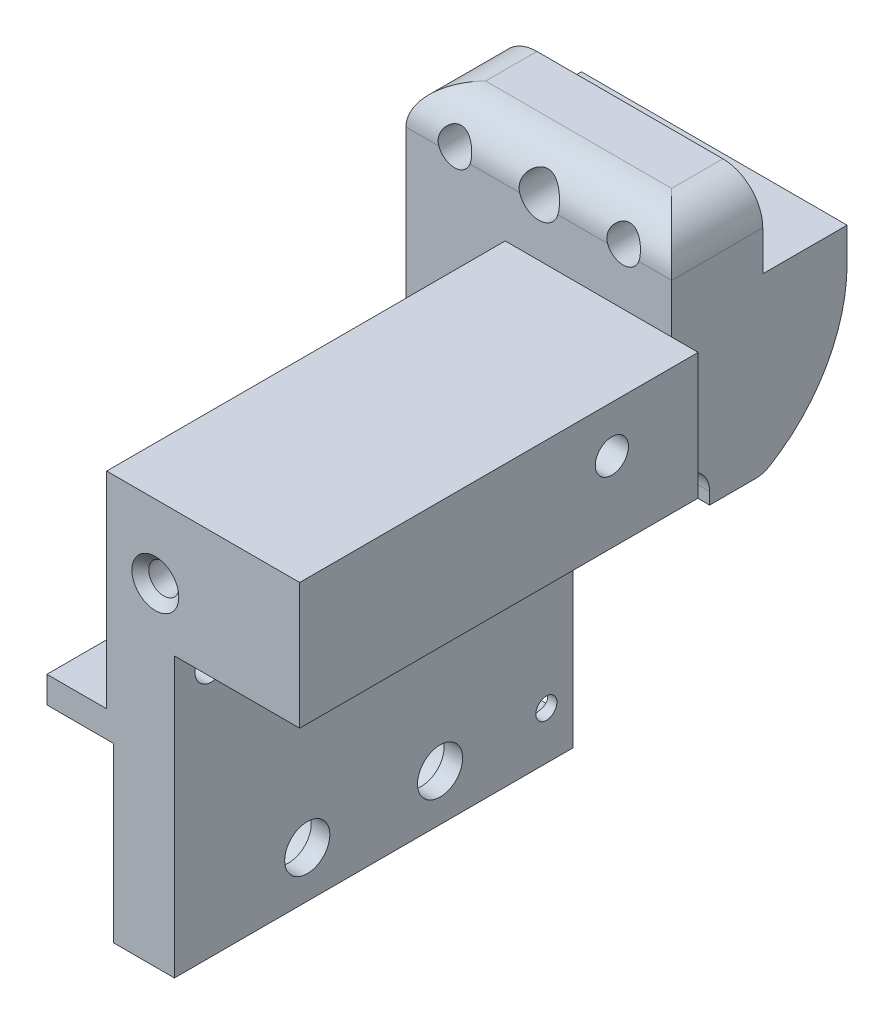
ISO-10303-21;
HEADER;
FILE_DESCRIPTION(('STEP AP214'),'2;1');
FILE_NAME('part.step','',(''),(''),'','','');
FILE_SCHEMA(('AUTOMOTIVE_DESIGN { 1 0 10303 214 1 1 1 1 }'));
ENDSEC;
DATA;
#1=APPLICATION_CONTEXT('core data for automotive mechanical design processes');
#2=APPLICATION_PROTOCOL_DEFINITION('international standard','automotive_design',2000,#1);
#3=PRODUCT_CONTEXT('',#1,'mechanical');
#4=PRODUCT('Part','Part','',(#3));
#5=PRODUCT_RELATED_PRODUCT_CATEGORY('part','',(#4));
#6=PRODUCT_DEFINITION_FORMATION('','',#4);
#7=PRODUCT_DEFINITION_CONTEXT('part definition',#1,'design');
#8=PRODUCT_DEFINITION('design','',#6,#7);
#9=PRODUCT_DEFINITION_SHAPE('','',#8);
#10=(LENGTH_UNIT() NAMED_UNIT(*) SI_UNIT(.MILLI.,.METRE.));
#11=(NAMED_UNIT(*) PLANE_ANGLE_UNIT() SI_UNIT($,.RADIAN.));
#12=(NAMED_UNIT(*) SI_UNIT($,.STERADIAN.) SOLID_ANGLE_UNIT());
#13=UNCERTAINTY_MEASURE_WITH_UNIT(LENGTH_MEASURE(1.E-05),#10,'distance_accuracy_value','');
#14=(GEOMETRIC_REPRESENTATION_CONTEXT(3) GLOBAL_UNCERTAINTY_ASSIGNED_CONTEXT((#13)) GLOBAL_UNIT_ASSIGNED_CONTEXT((#10,
#11,#12)) REPRESENTATION_CONTEXT('',''));
#15=CARTESIAN_POINT('',(0.,0.,0.));
#16=DIRECTION('',(0.,0.,1.));
#17=DIRECTION('',(1.,0.,0.));
#18=AXIS2_PLACEMENT_3D('',#15,#16,#17);
#19=CARTESIAN_POINT('',(-12.571,16.19,-30.));
#20=DIRECTION('',(0.,0.,1.));
#21=DIRECTION('',(1.,0.,0.));
#22=AXIS2_PLACEMENT_3D('',#19,#20,#21);
#23=PLANE('',#22);
#24=CARTESIAN_POINT('',(-2.571,13.619,-30.));
#25=DIRECTION('',(0.,0.,1.));
#26=DIRECTION('',(1.,0.,0.));
#27=AXIS2_PLACEMENT_3D('',#24,#25,#26);
#28=CIRCLE('',#27,1.5);
#29=CARTESIAN_POINT('',(-4.00834442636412,13.19,-30.));
#30=VERTEX_POINT('',#29);
#31=CARTESIAN_POINT('',(-1.13365557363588,13.19,-30.));
#32=VERTEX_POINT('',#31);
#33=EDGE_CURVE('E33',#30,#32,#28,.T.);
#34=ORIENTED_EDGE('',*,*,#33,.F.);
#35=DIRECTION('',(1.,0.,0.));
#36=VECTOR('',#35,1.);
#37=CARTESIAN_POINT('',(-12.571,13.19,-30.));
#38=LINE('',#37,#36);
#39=CARTESIAN_POINT('',(-7.7469220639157,13.19,-30.));
#40=VERTEX_POINT('',#39);
#41=EDGE_CURVE('E227',#30,#40,#38,.F.);
#42=ORIENTED_EDGE('',*,*,#41,.T.);
#43=CARTESIAN_POINT('',(-8.921,13.619,-30.));
#44=DIRECTION('',(0.,0.,1.));
#45=DIRECTION('',(1.,0.,0.));
#46=AXIS2_PLACEMENT_3D('',#43,#44,#45);
#47=CIRCLE('',#46,1.24999999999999);
#48=CARTESIAN_POINT('',(-10.0950779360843,13.19,-30.));
#49=VERTEX_POINT('',#48);
#50=EDGE_CURVE('E459',#49,#40,#47,.T.);
#51=ORIENTED_EDGE('',*,*,#50,.F.);
#52=DIRECTION('',(1.,0.,0.));
#53=VECTOR('',#52,1.);
#54=CARTESIAN_POINT('',(-12.571,13.19,-30.));
#55=LINE('',#54,#53);
#56=CARTESIAN_POINT('',(-12.571,13.19,-30.));
#57=VERTEX_POINT('',#56);
#58=EDGE_CURVE('E238',#49,#57,#55,.F.);
#59=ORIENTED_EDGE('',*,*,#58,.T.);
#60=DIRECTION('',(0.,-1.,0.));
#61=VECTOR('',#60,1.);
#62=CARTESIAN_POINT('',(-12.571,16.19,-30.));
#63=LINE('',#62,#61);
#64=CARTESIAN_POINT('',(-12.571,-2.888,-30.));
#65=VERTEX_POINT('',#64);
#66=EDGE_CURVE('E460',#57,#65,#63,.T.);
#67=ORIENTED_EDGE('',*,*,#66,.T.);
#68=DIRECTION('',(1.,0.,0.));
#69=VECTOR('',#68,1.);
#70=CARTESIAN_POINT('',(-12.571,-2.888,-30.));
#71=LINE('',#70,#69);
#72=CARTESIAN_POINT('',(-5.1,-2.888,-30.));
#73=VERTEX_POINT('',#72);
#74=EDGE_CURVE('E490',#65,#73,#71,.T.);
#75=ORIENTED_EDGE('',*,*,#74,.T.);
#76=DIRECTION('',(0.,-1.,0.));
#77=VECTOR('',#76,1.);
#78=CARTESIAN_POINT('',(-5.1,9.5,-30.));
#79=LINE('',#78,#77);
#80=CARTESIAN_POINT('',(-5.1,9.5,-30.));
#81=VERTEX_POINT('',#80);
#82=EDGE_CURVE('E514',#81,#73,#79,.T.);
#83=ORIENTED_EDGE('',*,*,#82,.F.);
#84=DIRECTION('',(-1.,0.,0.));
#85=VECTOR('',#84,1.);
#86=CARTESIAN_POINT('',(9.429,9.49999999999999,-30.));
#87=LINE('',#86,#85);
#88=CARTESIAN_POINT('',(7.429,9.49999999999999,-30.));
#89=VERTEX_POINT('',#88);
#90=EDGE_CURVE('E425',#89,#81,#87,.T.);
#91=ORIENTED_EDGE('',*,*,#90,.F.);
#92=DIRECTION('',(0.,-1.,0.));
#93=VECTOR('',#92,1.);
#94=CARTESIAN_POINT('',(7.429,16.19,-30.));
#95=LINE('',#94,#93);
#96=CARTESIAN_POINT('',(7.429,13.19,-30.));
#97=VERTEX_POINT('',#96);
#98=EDGE_CURVE('E619',#97,#89,#95,.T.);
#99=ORIENTED_EDGE('',*,*,#98,.F.);
#100=DIRECTION('',(1.,0.,0.));
#101=VECTOR('',#100,1.);
#102=CARTESIAN_POINT('',(-12.571,13.19,-30.));
#103=LINE('',#102,#101);
#104=CARTESIAN_POINT('',(4.9530779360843,13.19,-30.));
#105=VERTEX_POINT('',#104);
#106=EDGE_CURVE('E240',#97,#105,#103,.F.);
#107=ORIENTED_EDGE('',*,*,#106,.T.);
#108=CARTESIAN_POINT('',(3.779,13.619,-30.));
#109=DIRECTION('',(0.,0.,1.));
#110=DIRECTION('',(1.,0.,0.));
#111=AXIS2_PLACEMENT_3D('',#108,#109,#110);
#112=CIRCLE('',#111,1.24999999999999);
#113=CARTESIAN_POINT('',(2.6049220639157,13.19,-30.));
#114=VERTEX_POINT('',#113);
#115=EDGE_CURVE('E430',#114,#105,#112,.T.);
#116=ORIENTED_EDGE('',*,*,#115,.F.);
#117=EDGE_CURVE('E230',#114,#32,#38,.F.);
#118=ORIENTED_EDGE('',*,*,#117,.T.);
#119=EDGE_LOOP('',(#34,#42,#51,#59,#67,#75,#83,#91,#99,#107,#116,#118));
#120=FACE_BOUND('',#119,.T.);
#121=ADVANCED_FACE('F16',(#120),#23,.T.);
#122=CARTESIAN_POINT('',(-12.571,16.19,-36.86));
#123=DIRECTION('',(0.,1.,0.));
#124=DIRECTION('',(0.,0.,1.));
#125=AXIS2_PLACEMENT_3D('',#122,#123,#124);
#126=PLANE('',#125);
#127=DIRECTION('',(1.,0.,0.));
#128=VECTOR('',#127,1.);
#129=CARTESIAN_POINT('',(-12.571,16.19,-33.));
#130=LINE('',#129,#128);
#131=CARTESIAN_POINT('',(-9.571,16.19,-33.));
#132=VERTEX_POINT('',#131);
#133=CARTESIAN_POINT('',(4.429,16.19,-33.));
#134=VERTEX_POINT('',#133);
#135=EDGE_CURVE('E383',#132,#134,#130,.T.);
#136=ORIENTED_EDGE('',*,*,#135,.T.);
#137=DIRECTION('',(0.,0.,1.));
#138=VECTOR('',#137,1.);
#139=CARTESIAN_POINT('',(4.429,16.19,-36.86));
#140=LINE('',#139,#138);
#141=CARTESIAN_POINT('',(4.429,16.19,-36.86));
#142=VERTEX_POINT('',#141);
#143=EDGE_CURVE('E371',#134,#142,#140,.F.);
#144=ORIENTED_EDGE('',*,*,#143,.T.);
#145=DIRECTION('',(1.,0.,0.));
#146=VECTOR('',#145,1.);
#147=CARTESIAN_POINT('',(-12.571,16.19,-36.86));
#148=LINE('',#147,#146);
#149=CARTESIAN_POINT('',(-9.571,16.19,-36.86));
#150=VERTEX_POINT('',#149);
#151=EDGE_CURVE('E491',#150,#142,#148,.T.);
#152=ORIENTED_EDGE('',*,*,#151,.F.);
#153=DIRECTION('',(0.,0.,1.));
#154=VECTOR('',#153,1.);
#155=CARTESIAN_POINT('',(-9.571,16.19,-30.));
#156=LINE('',#155,#154);
#157=EDGE_CURVE('E385',#150,#132,#156,.T.);
#158=ORIENTED_EDGE('',*,*,#157,.T.);
#159=EDGE_LOOP('',(#136,#144,#152,#158));
#160=FACE_BOUND('',#159,.T.);
#161=ADVANCED_FACE('F277',(#160),#126,.T.);
#162=CARTESIAN_POINT('',(-12.571,10.19,-36.86));
#163=DIRECTION('',(0.,0.,-1.));
#164=DIRECTION('',(-1.,0.,0.));
#165=AXIS2_PLACEMENT_3D('',#162,#163,#164);
#166=PLANE('',#165);
#167=CARTESIAN_POINT('',(-2.571,13.619,-36.86));
#168=DIRECTION('',(0.,0.,-1.));
#169=DIRECTION('',(-1.,0.,0.));
#170=AXIS2_PLACEMENT_3D('',#167,#168,#169);
#171=CIRCLE('',#170,1.5);
#172=CARTESIAN_POINT('',(-4.071,13.619,-36.86));
#173=VERTEX_POINT('',#172);
#174=EDGE_CURVE('E232',#173,#173,#171,.T.);
#175=ORIENTED_EDGE('',*,*,#174,.F.);
#176=EDGE_LOOP('',(#175));
#177=FACE_BOUND('',#176,.T.);
#178=CARTESIAN_POINT('',(-8.921,13.619,-36.86));
#179=DIRECTION('',(0.,0.,-1.));
#180=DIRECTION('',(-1.,0.,0.));
#181=AXIS2_PLACEMENT_3D('',#178,#179,#180);
#182=CIRCLE('',#181,1.24999999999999);
#183=CARTESIAN_POINT('',(-10.171,13.619,-36.86));
#184=VERTEX_POINT('',#183);
#185=EDGE_CURVE('E461',#184,#184,#182,.T.);
#186=ORIENTED_EDGE('',*,*,#185,.F.);
#187=EDGE_LOOP('',(#186));
#188=FACE_BOUND('',#187,.T.);
#189=CARTESIAN_POINT('',(3.779,13.619,-36.86));
#190=DIRECTION('',(0.,0.,-1.));
#191=DIRECTION('',(-1.,0.,0.));
#192=AXIS2_PLACEMENT_3D('',#189,#190,#191);
#193=CIRCLE('',#192,1.24999999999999);
#194=CARTESIAN_POINT('',(2.52900000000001,13.619,-36.86));
#195=VERTEX_POINT('',#194);
#196=EDGE_CURVE('E469',#195,#195,#193,.T.);
#197=ORIENTED_EDGE('',*,*,#196,.F.);
#198=EDGE_LOOP('',(#197));
#199=FACE_BOUND('',#198,.T.);
#200=ORIENTED_EDGE('',*,*,#151,.T.);
#201=CARTESIAN_POINT('',(4.429,13.19,-36.86));
#202=DIRECTION('',(0.,0.,-1.));
#203=DIRECTION('',(-1.,0.,0.));
#204=AXIS2_PLACEMENT_3D('',#201,#202,#203);
#205=CIRCLE('',#204,3.);
#206=CARTESIAN_POINT('',(7.429,13.19,-36.86));
#207=VERTEX_POINT('',#206);
#208=EDGE_CURVE('E241',#142,#207,#205,.T.);
#209=ORIENTED_EDGE('',*,*,#208,.T.);
#210=DIRECTION('',(0.,1.,0.));
#211=VECTOR('',#210,1.);
#212=CARTESIAN_POINT('',(7.429,10.19,-36.86));
#213=LINE('',#212,#211);
#214=CARTESIAN_POINT('',(7.429,10.19,-36.86));
#215=VERTEX_POINT('',#214);
#216=EDGE_CURVE('E631',#215,#207,#213,.T.);
#217=ORIENTED_EDGE('',*,*,#216,.F.);
#218=DIRECTION('',(1.,0.,0.));
#219=VECTOR('',#218,1.);
#220=CARTESIAN_POINT('',(-12.571,10.19,-36.86));
#221=LINE('',#220,#219);
#222=CARTESIAN_POINT('',(-12.571,10.19,-36.86));
#223=VERTEX_POINT('',#222);
#224=EDGE_CURVE('E494',#223,#215,#221,.T.);
#225=ORIENTED_EDGE('',*,*,#224,.F.);
#226=DIRECTION('',(0.,1.,0.));
#227=VECTOR('',#226,1.);
#228=CARTESIAN_POINT('',(-12.571,10.19,-36.86));
#229=LINE('',#228,#227);
#230=CARTESIAN_POINT('',(-12.571,13.19,-36.86));
#231=VERTEX_POINT('',#230);
#232=EDGE_CURVE('E487',#223,#231,#229,.T.);
#233=ORIENTED_EDGE('',*,*,#232,.T.);
#234=CARTESIAN_POINT('',(-9.571,13.19,-36.86));
#235=DIRECTION('',(0.,0.,-1.));
#236=DIRECTION('',(-1.,0.,0.));
#237=AXIS2_PLACEMENT_3D('',#234,#235,#236);
#238=CIRCLE('',#237,3.);
#239=EDGE_CURVE('E379',#231,#150,#238,.T.);
#240=ORIENTED_EDGE('',*,*,#239,.T.);
#241=EDGE_LOOP('',(#200,#209,#217,#225,#233,#240));
#242=FACE_BOUND('',#241,.T.);
#243=ADVANCED_FACE('F280',(#177,#188,#199,#242),#166,.T.);
#244=CARTESIAN_POINT('',(-12.571,10.19,-43.21));
#245=DIRECTION('',(0.,1.,0.));
#246=DIRECTION('',(0.,0.,1.));
#247=AXIS2_PLACEMENT_3D('',#244,#245,#246);
#248=PLANE('',#247);
#249=ORIENTED_EDGE('',*,*,#224,.T.);
#250=DIRECTION('',(0.,0.,1.));
#251=VECTOR('',#250,1.);
#252=CARTESIAN_POINT('',(7.429,10.19,-43.21));
#253=LINE('',#252,#251);
#254=CARTESIAN_POINT('',(7.429,10.19,-43.21));
#255=VERTEX_POINT('',#254);
#256=EDGE_CURVE('E629',#255,#215,#253,.T.);
#257=ORIENTED_EDGE('',*,*,#256,.F.);
#258=DIRECTION('',(1.,0.,0.));
#259=VECTOR('',#258,1.);
#260=CARTESIAN_POINT('',(-12.571,10.19,-43.21));
#261=LINE('',#260,#259);
#262=CARTESIAN_POINT('',(-12.571,10.19,-43.21));
#263=VERTEX_POINT('',#262);
#264=EDGE_CURVE('E497',#263,#255,#261,.T.);
#265=ORIENTED_EDGE('',*,*,#264,.F.);
#266=DIRECTION('',(0.,0.,1.));
#267=VECTOR('',#266,1.);
#268=CARTESIAN_POINT('',(-12.571,10.19,-43.21));
#269=LINE('',#268,#267);
#270=EDGE_CURVE('E484',#263,#223,#269,.T.);
#271=ORIENTED_EDGE('',*,*,#270,.T.);
#272=EDGE_LOOP('',(#249,#257,#265,#271));
#273=FACE_BOUND('',#272,.T.);
#274=ADVANCED_FACE('F284',(#273),#248,.T.);
#275=CARTESIAN_POINT('',(-12.571,7.69,-43.21));
#276=DIRECTION('',(0.,0.,-1.));
#277=DIRECTION('',(-1.,0.,0.));
#278=AXIS2_PLACEMENT_3D('',#275,#276,#277);
#279=PLANE('',#278);
#280=ORIENTED_EDGE('',*,*,#264,.T.);
#281=DIRECTION('',(0.,1.,0.));
#282=VECTOR('',#281,1.);
#283=CARTESIAN_POINT('',(7.429,7.69,-43.21));
#284=LINE('',#283,#282);
#285=CARTESIAN_POINT('',(7.429,7.69,-43.21));
#286=VERTEX_POINT('',#285);
#287=EDGE_CURVE('E627',#286,#255,#284,.T.);
#288=ORIENTED_EDGE('',*,*,#287,.F.);
#289=DIRECTION('',(1.,0.,0.));
#290=VECTOR('',#289,1.);
#291=CARTESIAN_POINT('',(-12.571,7.69,-43.21));
#292=LINE('',#291,#290);
#293=CARTESIAN_POINT('',(-12.571,7.69,-43.21));
#294=VERTEX_POINT('',#293);
#295=EDGE_CURVE('E500',#294,#286,#292,.T.);
#296=ORIENTED_EDGE('',*,*,#295,.F.);
#297=DIRECTION('',(0.,1.,0.));
#298=VECTOR('',#297,1.);
#299=CARTESIAN_POINT('',(-12.571,7.69,-43.21));
#300=LINE('',#299,#298);
#301=EDGE_CURVE('E481',#294,#263,#300,.T.);
#302=ORIENTED_EDGE('',*,*,#301,.T.);
#303=EDGE_LOOP('',(#280,#288,#296,#302));
#304=FACE_BOUND('',#303,.T.);
#305=ADVANCED_FACE('F288',(#304),#279,.T.);
#306=CARTESIAN_POINT('',(-12.571,7.69,-31.224));
#307=DIRECTION('',(1.,0.,0.));
#308=DIRECTION('',(0.,0.,-1.));
#309=AXIS2_PLACEMENT_3D('',#306,#307,#308);
#310=CYLINDRICAL_SURFACE('',#309,11.986);
#311=ORIENTED_EDGE('',*,*,#295,.T.);
#312=CARTESIAN_POINT('',(7.429,7.69,-31.224));
#313=DIRECTION('',(1.,0.,0.));
#314=DIRECTION('',(0.,0.,-1.));
#315=AXIS2_PLACEMENT_3D('',#312,#313,#314);
#316=CIRCLE('',#315,11.986);
#317=CARTESIAN_POINT('',(7.429,-2.60600520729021,-37.3604870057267));
#318=VERTEX_POINT('',#317);
#319=EDGE_CURVE('E625',#318,#286,#316,.T.);
#320=ORIENTED_EDGE('',*,*,#319,.F.);
#321=DIRECTION('',(1.,0.,0.));
#322=VECTOR('',#321,1.);
#323=CARTESIAN_POINT('',(-12.571,-2.60600520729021,-37.3604870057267));
#324=LINE('',#323,#322);
#325=CARTESIAN_POINT('',(-12.571,-2.60600520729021,-37.3604870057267));
#326=VERTEX_POINT('',#325);
#327=EDGE_CURVE('E503',#326,#318,#324,.T.);
#328=ORIENTED_EDGE('',*,*,#327,.F.);
#329=CARTESIAN_POINT('',(-12.571,7.69,-31.224));
#330=DIRECTION('',(1.,0.,0.));
#331=DIRECTION('',(0.,0.,-1.));
#332=AXIS2_PLACEMENT_3D('',#329,#330,#331);
#333=CIRCLE('',#332,11.986);
#334=EDGE_CURVE('E478',#326,#294,#333,.T.);
#335=ORIENTED_EDGE('',*,*,#334,.T.);
#336=EDGE_LOOP('',(#311,#320,#328,#335));
#337=FACE_BOUND('',#336,.T.);
#338=ADVANCED_FACE('F292',(#337),#310,.T.);
#339=CARTESIAN_POINT('',(-12.571,-0.888,-36.3365445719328));
#340=DIRECTION('',(1.,0.,0.));
#341=DIRECTION('',(0.,0.,-1.));
#342=AXIS2_PLACEMENT_3D('',#339,#340,#341);
#343=CYLINDRICAL_SURFACE('',#342,2.);
#344=ORIENTED_EDGE('',*,*,#327,.T.);
#345=CARTESIAN_POINT('',(7.429,-0.888,-36.3365445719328));
#346=DIRECTION('',(1.,0.,0.));
#347=DIRECTION('',(0.,0.,-1.));
#348=AXIS2_PLACEMENT_3D('',#345,#346,#347);
#349=CIRCLE('',#348,2.);
#350=CARTESIAN_POINT('',(7.429,-2.888,-36.3365445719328));
#351=VERTEX_POINT('',#350);
#352=EDGE_CURVE('E623',#351,#318,#349,.T.);
#353=ORIENTED_EDGE('',*,*,#352,.F.);
#354=DIRECTION('',(1.,0.,0.));
#355=VECTOR('',#354,1.);
#356=CARTESIAN_POINT('',(-12.571,-2.888,-36.3365445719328));
#357=LINE('',#356,#355);
#358=CARTESIAN_POINT('',(-12.571,-2.888,-36.3365445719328));
#359=VERTEX_POINT('',#358);
#360=EDGE_CURVE('E506',#359,#351,#357,.T.);
#361=ORIENTED_EDGE('',*,*,#360,.F.);
#362=CARTESIAN_POINT('',(-12.571,-0.888,-36.3365445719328));
#363=DIRECTION('',(1.,0.,0.));
#364=DIRECTION('',(0.,0.,-1.));
#365=AXIS2_PLACEMENT_3D('',#362,#363,#364);
#366=CIRCLE('',#365,2.);
#367=EDGE_CURVE('E475',#359,#326,#366,.T.);
#368=ORIENTED_EDGE('',*,*,#367,.T.);
#369=EDGE_LOOP('',(#344,#353,#361,#368));
#370=FACE_BOUND('',#369,.T.);
#371=ADVANCED_FACE('F296',(#370),#343,.T.);
#372=CARTESIAN_POINT('',(-12.571,-2.888,-30.));
#373=DIRECTION('',(0.,-1.,0.));
#374=DIRECTION('',(0.,0.,-1.));
#375=AXIS2_PLACEMENT_3D('',#372,#373,#374);
#376=PLANE('',#375);
#377=DIRECTION('',(1.,0.,0.));
#378=VECTOR('',#377,1.);
#379=CARTESIAN_POINT('',(-4.06449800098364,-2.888,-32.86));
#380=LINE('',#379,#378);
#381=CARTESIAN_POINT('',(0.,-2.888,-32.86));
#382=VERTEX_POINT('',#381);
#383=CARTESIAN_POINT('',(7.429,-2.888,-32.86));
#384=VERTEX_POINT('',#383);
#385=EDGE_CURVE('E603',#382,#384,#380,.T.);
#386=ORIENTED_EDGE('',*,*,#385,.F.);
#387=DIRECTION('',(0.,0.,1.));
#388=VECTOR('',#387,1.);
#389=CARTESIAN_POINT('',(0.,-2.888,-32.86));
#390=LINE('',#389,#388);
#391=CARTESIAN_POINT('',(0.,-2.888,-32.));
#392=VERTEX_POINT('',#391);
#393=EDGE_CURVE('E597',#382,#392,#390,.T.);
#394=ORIENTED_EDGE('',*,*,#393,.T.);
#395=DIRECTION('',(1.,0.,0.));
#396=VECTOR('',#395,1.);
#397=CARTESIAN_POINT('',(-5.1,-2.888,-32.));
#398=LINE('',#397,#396);
#399=CARTESIAN_POINT('',(-5.1,-2.888,-32.));
#400=VERTEX_POINT('',#399);
#401=EDGE_CURVE('E453',#392,#400,#398,.F.);
#402=ORIENTED_EDGE('',*,*,#401,.T.);
#403=DIRECTION('',(0.,0.,1.));
#404=VECTOR('',#403,1.);
#405=CARTESIAN_POINT('',(-5.1,-2.888,-30.));
#406=LINE('',#405,#404);
#407=EDGE_CURVE('E450',#400,#73,#406,.T.);
#408=ORIENTED_EDGE('',*,*,#407,.T.);
#409=ORIENTED_EDGE('',*,*,#74,.F.);
#410=DIRECTION('',(0.,0.,-1.));
#411=VECTOR('',#410,1.);
#412=CARTESIAN_POINT('',(-12.571,-2.888,-30.));
#413=LINE('',#412,#411);
#414=EDGE_CURVE('E462',#65,#359,#413,.T.);
#415=ORIENTED_EDGE('',*,*,#414,.T.);
#416=ORIENTED_EDGE('',*,*,#360,.T.);
#417=DIRECTION('',(0.,0.,-1.));
#418=VECTOR('',#417,1.);
#419=CARTESIAN_POINT('',(7.429,-2.888,-30.));
#420=LINE('',#419,#418);
#421=EDGE_CURVE('E604',#384,#351,#420,.T.);
#422=ORIENTED_EDGE('',*,*,#421,.F.);
#423=EDGE_LOOP('',(#386,#394,#402,#408,#409,#415,#416,#422));
#424=FACE_BOUND('',#423,.T.);
#425=ADVANCED_FACE('F300',(#424),#376,.T.);
#426=CARTESIAN_POINT('',(0.,0.,-30.));
#427=DIRECTION('',(0.,0.,-1.));
#428=DIRECTION('',(-1.,0.,0.));
#429=AXIS2_PLACEMENT_3D('',#426,#427,#428);
#430=PLANE('',#429);
#431=CARTESIAN_POINT('',(-2.3,-17.5,-30.));
#432=DIRECTION('',(0.,0.,-1.));
#433=DIRECTION('',(-1.,0.,0.));
#434=AXIS2_PLACEMENT_3D('',#431,#432,#433);
#435=CIRCLE('',#434,1.6);
#436=CARTESIAN_POINT('',(-3.9,-17.5,-30.));
#437=VERTEX_POINT('',#436);
#438=EDGE_CURVE('E775',#437,#437,#435,.T.);
#439=ORIENTED_EDGE('',*,*,#438,.F.);
#440=EDGE_LOOP('',(#439));
#441=FACE_BOUND('',#440,.T.);
#442=CARTESIAN_POINT('',(-5.1,-4.888,-30.));
#443=VERTEX_POINT('',#442);
#444=CARTESIAN_POINT('',(-5.1,-6.,-30.));
#445=VERTEX_POINT('',#444);
#446=EDGE_CURVE('E518',#443,#445,#79,.T.);
#447=ORIENTED_EDGE('',*,*,#446,.F.);
#448=DIRECTION('',(1.,0.,0.));
#449=VECTOR('',#448,1.);
#450=CARTESIAN_POINT('',(0.,-4.888,-30.));
#451=LINE('',#450,#449);
#452=CARTESIAN_POINT('',(0.,-4.888,-30.));
#453=VERTEX_POINT('',#452);
#454=EDGE_CURVE('E447',#443,#453,#451,.T.);
#455=ORIENTED_EDGE('',*,*,#454,.T.);
#456=DIRECTION('',(0.,1.,0.));
#457=VECTOR('',#456,1.);
#458=CARTESIAN_POINT('',(0.,-21.,-30.));
#459=LINE('',#458,#457);
#460=CARTESIAN_POINT('',(0.,-21.,-30.));
#461=VERTEX_POINT('',#460);
#462=EDGE_CURVE('E429',#461,#453,#459,.T.);
#463=ORIENTED_EDGE('',*,*,#462,.F.);
#464=DIRECTION('',(1.,0.,0.));
#465=VECTOR('',#464,1.);
#466=CARTESIAN_POINT('',(-4.6,-21.,-30.));
#467=LINE('',#466,#465);
#468=CARTESIAN_POINT('',(-4.6,-21.,-30.));
#469=VERTEX_POINT('',#468);
#470=EDGE_CURVE('E530',#469,#461,#467,.T.);
#471=ORIENTED_EDGE('',*,*,#470,.F.);
#472=DIRECTION('',(0.,-1.,0.));
#473=VECTOR('',#472,1.);
#474=CARTESIAN_POINT('',(-4.60000000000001,-8.,-30.));
#475=LINE('',#474,#473);
#476=CARTESIAN_POINT('',(-4.60000000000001,-8.,-30.));
#477=VERTEX_POINT('',#476);
#478=EDGE_CURVE('E527',#477,#469,#475,.T.);
#479=ORIENTED_EDGE('',*,*,#478,.F.);
#480=DIRECTION('',(1.,0.,0.));
#481=VECTOR('',#480,1.);
#482=CARTESIAN_POINT('',(-9.6,-8.,-30.));
#483=LINE('',#482,#481);
#484=CARTESIAN_POINT('',(-9.6,-8.,-30.));
#485=VERTEX_POINT('',#484);
#486=EDGE_CURVE('E524',#485,#477,#483,.T.);
#487=ORIENTED_EDGE('',*,*,#486,.F.);
#488=DIRECTION('',(0.,-1.,0.));
#489=VECTOR('',#488,1.);
#490=CARTESIAN_POINT('',(-9.6,-6.,-30.));
#491=LINE('',#490,#489);
#492=CARTESIAN_POINT('',(-9.6,-6.,-30.));
#493=VERTEX_POINT('',#492);
#494=EDGE_CURVE('E521',#493,#485,#491,.T.);
#495=ORIENTED_EDGE('',*,*,#494,.F.);
#496=DIRECTION('',(-1.,0.,0.));
#497=VECTOR('',#496,1.);
#498=CARTESIAN_POINT('',(-5.1,-6.,-30.));
#499=LINE('',#498,#497);
#500=EDGE_CURVE('E517',#445,#493,#499,.T.);
#501=ORIENTED_EDGE('',*,*,#500,.F.);
#502=EDGE_LOOP('',(#447,#455,#463,#471,#479,#487,#495,#501));
#503=FACE_BOUND('',#502,.T.);
#504=ADVANCED_FACE('F304',(#441,#503),#430,.T.);
#505=CARTESIAN_POINT('',(0.,-21.,-30.));
#506=DIRECTION('',(1.,0.,0.));
#507=DIRECTION('',(0.,0.,-1.));
#508=AXIS2_PLACEMENT_3D('',#505,#506,#507);
#509=PLANE('',#508);
#510=CARTESIAN_POINT('',(0.,-17.41,-28.));
#511=DIRECTION('',(1.,0.,0.));
#512=DIRECTION('',(0.,0.,-1.));
#513=AXIS2_PLACEMENT_3D('',#510,#511,#512);
#514=CIRCLE('',#513,0.793749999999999);
#515=CARTESIAN_POINT('',(0.,-17.41,-28.79375));
#516=VERTEX_POINT('',#515);
#517=EDGE_CURVE('E778',#516,#516,#514,.T.);
#518=ORIENTED_EDGE('',*,*,#517,.F.);
#519=EDGE_LOOP('',(#518));
#520=FACE_BOUND('',#519,.T.);
#521=CARTESIAN_POINT('',(0.,-1.85,-24.8));
#522=DIRECTION('',(1.,0.,0.));
#523=DIRECTION('',(0.,0.,-1.));
#524=AXIS2_PLACEMENT_3D('',#521,#522,#523);
#525=CIRCLE('',#524,1.25);
#526=CARTESIAN_POINT('',(0.,-1.85,-26.05));
#527=VERTEX_POINT('',#526);
#528=EDGE_CURVE('E389',#527,#527,#525,.T.);
#529=ORIENTED_EDGE('',*,*,#528,.F.);
#530=EDGE_LOOP('',(#529));
#531=FACE_BOUND('',#530,.T.);
#532=CARTESIAN_POINT('',(0.,-1.85,-2.8));
#533=DIRECTION('',(1.,0.,0.));
#534=DIRECTION('',(0.,0.,-1.));
#535=AXIS2_PLACEMENT_3D('',#532,#533,#534);
#536=CIRCLE('',#535,1.25);
#537=CARTESIAN_POINT('',(0.,-1.85,-4.05));
#538=VERTEX_POINT('',#537);
#539=EDGE_CURVE('E744',#538,#538,#536,.T.);
#540=ORIENTED_EDGE('',*,*,#539,.F.);
#541=EDGE_LOOP('',(#540));
#542=FACE_BOUND('',#541,.T.);
#543=CARTESIAN_POINT('',(0.,-2.5,-20.));
#544=DIRECTION('',(1.,0.,0.));
#545=DIRECTION('',(0.,0.,-1.));
#546=AXIS2_PLACEMENT_3D('',#543,#544,#545);
#547=CIRCLE('',#546,1.7);
#548=CARTESIAN_POINT('',(0.,-2.5,-21.7));
#549=VERTEX_POINT('',#548);
#550=EDGE_CURVE('E394',#549,#549,#547,.T.);
#551=ORIENTED_EDGE('',*,*,#550,.F.);
#552=EDGE_LOOP('',(#551));
#553=FACE_BOUND('',#552,.T.);
#554=CARTESIAN_POINT('',(0.,-2.5,-10.));
#555=DIRECTION('',(1.,0.,0.));
#556=DIRECTION('',(0.,0.,-1.));
#557=AXIS2_PLACEMENT_3D('',#554,#555,#556);
#558=CIRCLE('',#557,1.7);
#559=CARTESIAN_POINT('',(0.,-2.5,-11.7));
#560=VERTEX_POINT('',#559);
#561=EDGE_CURVE('E399',#560,#560,#558,.T.);
#562=ORIENTED_EDGE('',*,*,#561,.F.);
#563=EDGE_LOOP('',(#562));
#564=FACE_BOUND('',#563,.T.);
#565=CARTESIAN_POINT('',(0.,-17.5,-10.));
#566=DIRECTION('',(1.,0.,0.));
#567=DIRECTION('',(0.,0.,-1.));
#568=AXIS2_PLACEMENT_3D('',#565,#566,#567);
#569=CIRCLE('',#568,1.7);
#570=CARTESIAN_POINT('',(0.,-17.5,-11.7));
#571=VERTEX_POINT('',#570);
#572=EDGE_CURVE('E408',#571,#571,#569,.T.);
#573=ORIENTED_EDGE('',*,*,#572,.F.);
#574=EDGE_LOOP('',(#573));
#575=FACE_BOUND('',#574,.T.);
#576=CARTESIAN_POINT('',(0.,-17.5,-20.));
#577=DIRECTION('',(1.,0.,0.));
#578=DIRECTION('',(0.,0.,-1.));
#579=AXIS2_PLACEMENT_3D('',#576,#577,#578);
#580=CIRCLE('',#579,1.7);
#581=CARTESIAN_POINT('',(0.,-17.5,-21.7));
#582=VERTEX_POINT('',#581);
#583=EDGE_CURVE('E416',#582,#582,#580,.T.);
#584=ORIENTED_EDGE('',*,*,#583,.F.);
#585=EDGE_LOOP('',(#584));
#586=FACE_BOUND('',#585,.T.);
#587=CARTESIAN_POINT('',(0.,-2.,-30.86));
#588=DIRECTION('',(1.,0.,0.));
#589=DIRECTION('',(0.,0.,-1.));
#590=AXIS2_PLACEMENT_3D('',#587,#588,#589);
#591=CIRCLE('',#590,2.);
#592=CARTESIAN_POINT('',(0.,0.,-30.86));
#593=VERTEX_POINT('',#592);
#594=CARTESIAN_POINT('',(0.,-2.,-32.86));
#595=VERTEX_POINT('',#594);
#596=EDGE_CURVE('E579',#593,#595,#591,.F.);
#597=ORIENTED_EDGE('',*,*,#596,.F.);
#598=DIRECTION('',(0.,0.,1.));
#599=VECTOR('',#598,1.);
#600=CARTESIAN_POINT('',(0.,0.,-30.));
#601=LINE('',#600,#599);
#602=CARTESIAN_POINT('',(0.,0.,0.));
#603=VERTEX_POINT('',#602);
#604=EDGE_CURVE('E444',#593,#603,#601,.T.);
#605=ORIENTED_EDGE('',*,*,#604,.T.);
#606=DIRECTION('',(0.,1.,0.));
#607=VECTOR('',#606,1.);
#608=CARTESIAN_POINT('',(0.,-21.,0.));
#609=LINE('',#608,#607);
#610=CARTESIAN_POINT('',(0.,-21.,0.));
#611=VERTEX_POINT('',#610);
#612=EDGE_CURVE('E493',#611,#603,#609,.T.);
#613=ORIENTED_EDGE('',*,*,#612,.F.);
#614=DIRECTION('',(0.,0.,1.));
#615=VECTOR('',#614,1.);
#616=CARTESIAN_POINT('',(0.,-21.,-30.));
#617=LINE('',#616,#615);
#618=EDGE_CURVE('E451',#461,#611,#617,.T.);
#619=ORIENTED_EDGE('',*,*,#618,.F.);
#620=ORIENTED_EDGE('',*,*,#462,.T.);
#621=CARTESIAN_POINT('',(0.,-4.888,-32.));
#622=DIRECTION('',(1.,0.,0.));
#623=DIRECTION('',(0.,0.,-1.));
#624=AXIS2_PLACEMENT_3D('',#621,#622,#623);
#625=CIRCLE('',#624,2.);
#626=EDGE_CURVE('E456',#453,#392,#625,.F.);
#627=ORIENTED_EDGE('',*,*,#626,.T.);
#628=ORIENTED_EDGE('',*,*,#393,.F.);
#629=DIRECTION('',(0.,-1.,0.));
#630=VECTOR('',#629,1.);
#631=CARTESIAN_POINT('',(0.,-2.,-32.86));
#632=LINE('',#631,#630);
#633=EDGE_CURVE('E599',#595,#382,#632,.T.);
#634=ORIENTED_EDGE('',*,*,#633,.F.);
#635=EDGE_LOOP('',(#597,#605,#613,#619,#620,#627,#628,#634));
#636=FACE_BOUND('',#635,.T.);
#637=ADVANCED_FACE('F310',(#520,#531,#542,#553,#564,#575,#586,#636),#509,.T.);
#638=CARTESIAN_POINT('',(-4.6,-21.,-30.));
#639=DIRECTION('',(0.,-1.,0.));
#640=DIRECTION('',(1.,0.,0.));
#641=AXIS2_PLACEMENT_3D('',#638,#639,#640);
#642=PLANE('',#641);
#643=DIRECTION('',(1.,0.,0.));
#644=VECTOR('',#643,1.);
#645=CARTESIAN_POINT('',(-4.6,-21.,0.));
#646=LINE('',#645,#644);
#647=CARTESIAN_POINT('',(-4.6,-21.,0.));
#648=VERTEX_POINT('',#647);
#649=EDGE_CURVE('E513',#648,#611,#646,.T.);
#650=ORIENTED_EDGE('',*,*,#649,.F.);
#651=DIRECTION('',(0.,0.,1.));
#652=VECTOR('',#651,1.);
#653=CARTESIAN_POINT('',(-4.6,-21.,-30.));
#654=LINE('',#653,#652);
#655=EDGE_CURVE('E562',#469,#648,#654,.T.);
#656=ORIENTED_EDGE('',*,*,#655,.F.);
#657=ORIENTED_EDGE('',*,*,#470,.T.);
#658=ORIENTED_EDGE('',*,*,#618,.T.);
#659=EDGE_LOOP('',(#650,#656,#657,#658));
#660=FACE_BOUND('',#659,.T.);
#661=ADVANCED_FACE('F316',(#660),#642,.T.);
#662=CARTESIAN_POINT('',(-4.60000000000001,-8.,-30.));
#663=DIRECTION('',(-1.,0.,0.));
#664=DIRECTION('',(0.,-1.,0.));
#665=AXIS2_PLACEMENT_3D('',#662,#663,#664);
#666=PLANE('',#665);
#667=CARTESIAN_POINT('',(-4.6,-17.5,-10.));
#668=DIRECTION('',(-1.,0.,0.));
#669=DIRECTION('',(0.,-1.,0.));
#670=AXIS2_PLACEMENT_3D('',#667,#668,#669);
#671=CIRCLE('',#670,3.25);
#672=CARTESIAN_POINT('',(-4.6,-20.75,-10.));
#673=VERTEX_POINT('',#672);
#674=EDGE_CURVE('E404',#673,#673,#671,.T.);
#675=ORIENTED_EDGE('',*,*,#674,.F.);
#676=EDGE_LOOP('',(#675));
#677=FACE_BOUND('',#676,.T.);
#678=CARTESIAN_POINT('',(-4.6,-17.5,-20.));
#679=DIRECTION('',(-1.,0.,0.));
#680=DIRECTION('',(0.,-1.,0.));
#681=AXIS2_PLACEMENT_3D('',#678,#679,#680);
#682=CIRCLE('',#681,3.25);
#683=CARTESIAN_POINT('',(-4.6,-20.75,-20.));
#684=VERTEX_POINT('',#683);
#685=EDGE_CURVE('E412',#684,#684,#682,.T.);
#686=ORIENTED_EDGE('',*,*,#685,.F.);
#687=EDGE_LOOP('',(#686));
#688=FACE_BOUND('',#687,.T.);
#689=DIRECTION('',(0.,-1.,0.));
#690=VECTOR('',#689,1.);
#691=CARTESIAN_POINT('',(-4.60000000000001,-8.,0.));
#692=LINE('',#691,#690);
#693=CARTESIAN_POINT('',(-4.60000000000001,-8.,0.));
#694=VERTEX_POINT('',#693);
#695=EDGE_CURVE('E556',#694,#648,#692,.T.);
#696=ORIENTED_EDGE('',*,*,#695,.F.);
#697=DIRECTION('',(0.,0.,1.));
#698=VECTOR('',#697,1.);
#699=CARTESIAN_POINT('',(-4.60000000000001,-8.,-30.));
#700=LINE('',#699,#698);
#701=EDGE_CURVE('E564',#477,#694,#700,.T.);
#702=ORIENTED_EDGE('',*,*,#701,.F.);
#703=ORIENTED_EDGE('',*,*,#478,.T.);
#704=ORIENTED_EDGE('',*,*,#655,.T.);
#705=EDGE_LOOP('',(#696,#702,#703,#704));
#706=FACE_BOUND('',#705,.T.);
#707=ADVANCED_FACE('F319',(#677,#688,#706),#666,.T.);
#708=CARTESIAN_POINT('',(-9.6,-8.,-30.));
#709=DIRECTION('',(0.,-1.,0.));
#710=DIRECTION('',(0.,0.,-1.));
#711=AXIS2_PLACEMENT_3D('',#708,#709,#710);
#712=PLANE('',#711);
#713=CARTESIAN_POINT('',(-7.481,-8.,-25.));
#714=DIRECTION('',(0.,-1.,0.));
#715=DIRECTION('',(0.,0.,-1.));
#716=AXIS2_PLACEMENT_3D('',#713,#714,#715);
#717=CIRCLE('',#716,1.24999999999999);
#718=CARTESIAN_POINT('',(-7.481,-8.,-26.25));
#719=VERTEX_POINT('',#718);
#720=EDGE_CURVE('E762',#719,#719,#717,.T.);
#721=ORIENTED_EDGE('',*,*,#720,.F.);
#722=EDGE_LOOP('',(#721));
#723=FACE_BOUND('',#722,.T.);
#724=CARTESIAN_POINT('',(-7.481,-8.,-5.));
#725=DIRECTION('',(0.,-1.,0.));
#726=DIRECTION('',(0.,0.,-1.));
#727=AXIS2_PLACEMENT_3D('',#724,#725,#726);
#728=CIRCLE('',#727,1.24999999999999);
#729=CARTESIAN_POINT('',(-7.481,-8.,-6.24999999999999));
#730=VERTEX_POINT('',#729);
#731=EDGE_CURVE('E756',#730,#730,#728,.T.);
#732=ORIENTED_EDGE('',*,*,#731,.F.);
#733=EDGE_LOOP('',(#732));
#734=FACE_BOUND('',#733,.T.);
#735=CARTESIAN_POINT('',(-7.481,-8.,-15.));
#736=DIRECTION('',(0.,-1.,0.));
#737=DIRECTION('',(0.,0.,-1.));
#738=AXIS2_PLACEMENT_3D('',#735,#736,#737);
#739=CIRCLE('',#738,2.2);
#740=CARTESIAN_POINT('',(-9.6,-8.,-15.5914718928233));
#741=VERTEX_POINT('',#740);
#742=CARTESIAN_POINT('',(-9.6,-8.,-14.4085281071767));
#743=VERTEX_POINT('',#742);
#744=EDGE_CURVE('E41',#741,#743,#739,.T.);
#745=ORIENTED_EDGE('',*,*,#744,.F.);
#746=DIRECTION('',(0.,0.,1.));
#747=VECTOR('',#746,1.);
#748=CARTESIAN_POINT('',(-9.6,-8.,-30.));
#749=LINE('',#748,#747);
#750=EDGE_CURVE('E566',#485,#741,#749,.T.);
#751=ORIENTED_EDGE('',*,*,#750,.F.);
#752=ORIENTED_EDGE('',*,*,#486,.T.);
#753=ORIENTED_EDGE('',*,*,#701,.T.);
#754=DIRECTION('',(1.,0.,0.));
#755=VECTOR('',#754,1.);
#756=CARTESIAN_POINT('',(-9.6,-8.,0.));
#757=LINE('',#756,#755);
#758=CARTESIAN_POINT('',(-9.6,-8.,0.));
#759=VERTEX_POINT('',#758);
#760=EDGE_CURVE('E553',#759,#694,#757,.T.);
#761=ORIENTED_EDGE('',*,*,#760,.F.);
#762=EDGE_CURVE('E569',#743,#759,#749,.T.);
#763=ORIENTED_EDGE('',*,*,#762,.F.);
#764=EDGE_LOOP('',(#745,#751,#752,#753,#761,#763));
#765=FACE_BOUND('',#764,.T.);
#766=ADVANCED_FACE('F323',(#723,#734,#765),#712,.T.);
#767=CARTESIAN_POINT('',(-9.6,-6.,-30.));
#768=DIRECTION('',(-1.,0.,0.));
#769=DIRECTION('',(0.,0.,1.));
#770=AXIS2_PLACEMENT_3D('',#767,#768,#769);
#771=PLANE('',#770);
#772=DIRECTION('',(0.,-1.,0.));
#773=VECTOR('',#772,1.);
#774=CARTESIAN_POINT('',(-9.6,-8.,-15.5914718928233));
#775=LINE('',#774,#773);
#776=CARTESIAN_POINT('',(-9.6,-7.,-15.5914718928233));
#777=VERTEX_POINT('',#776);
#778=EDGE_CURVE('E28',#777,#741,#775,.T.);
#779=ORIENTED_EDGE('',*,*,#778,.F.);
#780=DIRECTION('',(0.,0.,-1.));
#781=VECTOR('',#780,1.);
#782=CARTESIAN_POINT('',(-9.6,-7.,-30.));
#783=LINE('',#782,#781);
#784=CARTESIAN_POINT('',(-9.6,-7.,-14.4085281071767));
#785=VERTEX_POINT('',#784);
#786=EDGE_CURVE('E668',#785,#777,#783,.T.);
#787=ORIENTED_EDGE('',*,*,#786,.F.);
#788=DIRECTION('',(0.,-1.,0.));
#789=VECTOR('',#788,1.);
#790=CARTESIAN_POINT('',(-9.6,-8.,-14.4085281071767));
#791=LINE('',#790,#789);
#792=EDGE_CURVE('E666',#743,#785,#791,.F.);
#793=ORIENTED_EDGE('',*,*,#792,.F.);
#794=ORIENTED_EDGE('',*,*,#762,.T.);
#795=DIRECTION('',(0.,-1.,0.));
#796=VECTOR('',#795,1.);
#797=CARTESIAN_POINT('',(-9.6,-6.,0.));
#798=LINE('',#797,#796);
#799=CARTESIAN_POINT('',(-9.6,-6.,0.));
#800=VERTEX_POINT('',#799);
#801=EDGE_CURVE('E550',#800,#759,#798,.T.);
#802=ORIENTED_EDGE('',*,*,#801,.F.);
#803=DIRECTION('',(0.,0.,1.));
#804=VECTOR('',#803,1.);
#805=CARTESIAN_POINT('',(-9.6,-6.,-30.));
#806=LINE('',#805,#804);
#807=EDGE_CURVE('E570',#493,#800,#806,.T.);
#808=ORIENTED_EDGE('',*,*,#807,.F.);
#809=ORIENTED_EDGE('',*,*,#494,.T.);
#810=ORIENTED_EDGE('',*,*,#750,.T.);
#811=EDGE_LOOP('',(#779,#787,#793,#794,#802,#808,#809,#810));
#812=FACE_BOUND('',#811,.T.);
#813=ADVANCED_FACE('F327',(#812),#771,.T.);
#814=CARTESIAN_POINT('',(-5.1,-6.,-30.));
#815=DIRECTION('',(0.,1.,0.));
#816=DIRECTION('',(-1.,0.,0.));
#817=AXIS2_PLACEMENT_3D('',#814,#815,#816);
#818=PLANE('',#817);
#819=CARTESIAN_POINT('',(-7.481,-6.,-25.));
#820=DIRECTION('',(0.,1.,0.));
#821=DIRECTION('',(-1.,0.,0.));
#822=AXIS2_PLACEMENT_3D('',#819,#820,#821);
#823=CIRCLE('',#822,1.24999999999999);
#824=CARTESIAN_POINT('',(-8.73099999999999,-6.,-25.));
#825=VERTEX_POINT('',#824);
#826=EDGE_CURVE('E759',#825,#825,#823,.T.);
#827=ORIENTED_EDGE('',*,*,#826,.F.);
#828=EDGE_LOOP('',(#827));
#829=FACE_BOUND('',#828,.T.);
#830=CARTESIAN_POINT('',(-7.481,-6.,-5.));
#831=DIRECTION('',(0.,1.,0.));
#832=DIRECTION('',(-1.,0.,0.));
#833=AXIS2_PLACEMENT_3D('',#830,#831,#832);
#834=CIRCLE('',#833,1.24999999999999);
#835=CARTESIAN_POINT('',(-8.73099999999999,-6.,-5.));
#836=VERTEX_POINT('',#835);
#837=EDGE_CURVE('E679',#836,#836,#834,.T.);
#838=ORIENTED_EDGE('',*,*,#837,.F.);
#839=EDGE_LOOP('',(#838));
#840=FACE_BOUND('',#839,.T.);
#841=CARTESIAN_POINT('',(-7.481,-6.,-15.));
#842=DIRECTION('',(0.,1.,0.));
#843=DIRECTION('',(-1.,0.,0.));
#844=AXIS2_PLACEMENT_3D('',#841,#842,#843);
#845=CIRCLE('',#844,1.2);
#846=CARTESIAN_POINT('',(-8.681,-6.,-15.));
#847=VERTEX_POINT('',#846);
#848=EDGE_CURVE('E660',#847,#847,#845,.T.);
#849=ORIENTED_EDGE('',*,*,#848,.F.);
#850=EDGE_LOOP('',(#849));
#851=FACE_BOUND('',#850,.T.);
#852=DIRECTION('',(-1.,0.,0.));
#853=VECTOR('',#852,1.);
#854=CARTESIAN_POINT('',(-5.1,-6.,0.));
#855=LINE('',#854,#853);
#856=CARTESIAN_POINT('',(-5.1,-6.,0.));
#857=VERTEX_POINT('',#856);
#858=EDGE_CURVE('E547',#857,#800,#855,.T.);
#859=ORIENTED_EDGE('',*,*,#858,.F.);
#860=DIRECTION('',(0.,0.,1.));
#861=VECTOR('',#860,1.);
#862=CARTESIAN_POINT('',(-5.1,-6.,-30.));
#863=LINE('',#862,#861);
#864=EDGE_CURVE('E572',#445,#857,#863,.T.);
#865=ORIENTED_EDGE('',*,*,#864,.F.);
#866=ORIENTED_EDGE('',*,*,#500,.T.);
#867=ORIENTED_EDGE('',*,*,#807,.T.);
#868=EDGE_LOOP('',(#859,#865,#866,#867));
#869=FACE_BOUND('',#868,.T.);
#870=ADVANCED_FACE('F331',(#829,#840,#851,#869),#818,.T.);
#871=CARTESIAN_POINT('',(-5.1,9.5,-30.));
#872=DIRECTION('',(-1.,0.,0.));
#873=DIRECTION('',(0.,0.,1.));
#874=AXIS2_PLACEMENT_3D('',#871,#872,#873);
#875=PLANE('',#874);
#876=CARTESIAN_POINT('',(-5.1,-1.85,-24.8));
#877=DIRECTION('',(-1.,0.,0.));
#878=DIRECTION('',(0.,0.,1.));
#879=AXIS2_PLACEMENT_3D('',#876,#877,#878);
#880=CIRCLE('',#879,1.25);
#881=CARTESIAN_POINT('',(-5.1,-1.85,-23.55));
#882=VERTEX_POINT('',#881);
#883=EDGE_CURVE('E393',#882,#882,#880,.T.);
#884=ORIENTED_EDGE('',*,*,#883,.F.);
#885=EDGE_LOOP('',(#884));
#886=FACE_BOUND('',#885,.T.);
#887=CARTESIAN_POINT('',(-5.1,-1.85,-2.8));
#888=DIRECTION('',(-1.,0.,0.));
#889=DIRECTION('',(0.,0.,1.));
#890=AXIS2_PLACEMENT_3D('',#887,#888,#889);
#891=CIRCLE('',#890,1.25);
#892=CARTESIAN_POINT('',(-5.1,-1.85,-1.55));
#893=VERTEX_POINT('',#892);
#894=EDGE_CURVE('E392',#893,#893,#891,.T.);
#895=ORIENTED_EDGE('',*,*,#894,.F.);
#896=EDGE_LOOP('',(#895));
#897=FACE_BOUND('',#896,.T.);
#898=CARTESIAN_POINT('',(-5.1,-2.5,-20.));
#899=DIRECTION('',(-1.,0.,0.));
#900=DIRECTION('',(0.,0.,1.));
#901=AXIS2_PLACEMENT_3D('',#898,#899,#900);
#902=CIRCLE('',#901,3.25);
#903=CARTESIAN_POINT('',(-5.1,-2.5,-16.75));
#904=VERTEX_POINT('',#903);
#905=EDGE_CURVE('E741',#904,#904,#902,.T.);
#906=ORIENTED_EDGE('',*,*,#905,.F.);
#907=EDGE_LOOP('',(#906));
#908=FACE_BOUND('',#907,.T.);
#909=CARTESIAN_POINT('',(-5.1,-2.5,-10.));
#910=DIRECTION('',(-1.,0.,0.));
#911=DIRECTION('',(0.,0.,1.));
#912=AXIS2_PLACEMENT_3D('',#909,#910,#911);
#913=CIRCLE('',#912,3.25);
#914=CARTESIAN_POINT('',(-5.1,-2.5,-6.75));
#915=VERTEX_POINT('',#914);
#916=EDGE_CURVE('E397',#915,#915,#913,.T.);
#917=ORIENTED_EDGE('',*,*,#916,.F.);
#918=EDGE_LOOP('',(#917));
#919=FACE_BOUND('',#918,.T.);
#920=CARTESIAN_POINT('',(-5.1,6.,-23.5));
#921=DIRECTION('',(-1.,0.,0.));
#922=DIRECTION('',(0.,0.,1.));
#923=AXIS2_PLACEMENT_3D('',#920,#921,#922);
#924=CIRCLE('',#923,1.25);
#925=CARTESIAN_POINT('',(-5.1,6.,-22.25));
#926=VERTEX_POINT('',#925);
#927=EDGE_CURVE('E420',#926,#926,#924,.T.);
#928=ORIENTED_EDGE('',*,*,#927,.F.);
#929=EDGE_LOOP('',(#928));
#930=FACE_BOUND('',#929,.T.);
#931=DIRECTION('',(0.,-1.,0.));
#932=VECTOR('',#931,1.);
#933=CARTESIAN_POINT('',(-5.1,9.5,0.));
#934=LINE('',#933,#932);
#935=CARTESIAN_POINT('',(-5.1,9.5,0.));
#936=VERTEX_POINT('',#935);
#937=EDGE_CURVE('E544',#936,#857,#934,.T.);
#938=ORIENTED_EDGE('',*,*,#937,.F.);
#939=DIRECTION('',(0.,0.,1.));
#940=VECTOR('',#939,1.);
#941=CARTESIAN_POINT('',(-5.1,9.5,-30.));
#942=LINE('',#941,#940);
#943=EDGE_CURVE('E439',#81,#936,#942,.T.);
#944=ORIENTED_EDGE('',*,*,#943,.F.);
#945=ORIENTED_EDGE('',*,*,#82,.T.);
#946=ORIENTED_EDGE('',*,*,#407,.F.);
#947=CARTESIAN_POINT('',(-5.1,-4.888,-32.));
#948=DIRECTION('',(-1.,0.,0.));
#949=DIRECTION('',(0.,0.,1.));
#950=AXIS2_PLACEMENT_3D('',#947,#948,#949);
#951=CIRCLE('',#950,2.);
#952=EDGE_CURVE('E388',#400,#443,#951,.F.);
#953=ORIENTED_EDGE('',*,*,#952,.T.);
#954=ORIENTED_EDGE('',*,*,#446,.T.);
#955=ORIENTED_EDGE('',*,*,#864,.T.);
#956=EDGE_LOOP('',(#938,#944,#945,#946,#953,#954,#955));
#957=FACE_BOUND('',#956,.T.);
#958=ADVANCED_FACE('F335',(#886,#897,#908,#919,#930,#957),#875,.T.);
#959=CARTESIAN_POINT('',(9.429,9.49999999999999,-30.));
#960=DIRECTION('',(0.,1.,0.));
#961=DIRECTION('',(-1.,0.,0.));
#962=AXIS2_PLACEMENT_3D('',#959,#960,#961);
#963=PLANE('',#962);
#964=DIRECTION('',(-1.,0.,0.));
#965=VECTOR('',#964,1.);
#966=CARTESIAN_POINT('',(9.429,9.49999999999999,0.));
#967=LINE('',#966,#965);
#968=CARTESIAN_POINT('',(9.429,9.49999999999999,0.));
#969=VERTEX_POINT('',#968);
#970=EDGE_CURVE('E541',#969,#936,#967,.T.);
#971=ORIENTED_EDGE('',*,*,#970,.F.);
#972=DIRECTION('',(0.,0.,1.));
#973=VECTOR('',#972,1.);
#974=CARTESIAN_POINT('',(9.429,9.49999999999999,-30.));
#975=LINE('',#974,#973);
#976=CARTESIAN_POINT('',(9.429,9.49999999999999,-30.));
#977=VERTEX_POINT('',#976);
#978=EDGE_CURVE('E436',#977,#969,#975,.T.);
#979=ORIENTED_EDGE('',*,*,#978,.F.);
#980=EDGE_CURVE('E428',#977,#89,#87,.T.);
#981=ORIENTED_EDGE('',*,*,#980,.T.);
#982=ORIENTED_EDGE('',*,*,#90,.T.);
#983=ORIENTED_EDGE('',*,*,#943,.T.);
#984=EDGE_LOOP('',(#971,#979,#981,#982,#983));
#985=FACE_BOUND('',#984,.T.);
#986=ADVANCED_FACE('F339',(#985),#963,.T.);
#987=CARTESIAN_POINT('',(9.429,0.,-30.));
#988=DIRECTION('',(1.,0.,0.));
#989=DIRECTION('',(0.,0.,-1.));
#990=AXIS2_PLACEMENT_3D('',#987,#988,#989);
#991=PLANE('',#990);
#992=CARTESIAN_POINT('',(9.429,6.,-23.5));
#993=DIRECTION('',(1.,0.,0.));
#994=DIRECTION('',(0.,0.,-1.));
#995=AXIS2_PLACEMENT_3D('',#992,#993,#994);
#996=CIRCLE('',#995,1.25);
#997=CARTESIAN_POINT('',(9.429,6.,-24.75));
#998=VERTEX_POINT('',#997);
#999=EDGE_CURVE('E424',#998,#998,#996,.T.);
#1000=ORIENTED_EDGE('',*,*,#999,.F.);
#1001=EDGE_LOOP('',(#1000));
#1002=FACE_BOUND('',#1001,.T.);
#1003=DIRECTION('',(0.,-1.,0.));
#1004=VECTOR('',#1003,1.);
#1005=CARTESIAN_POINT('',(9.429,16.19,-30.));
#1006=LINE('',#1005,#1004);
#1007=CARTESIAN_POINT('',(9.429,0.,-30.));
#1008=VERTEX_POINT('',#1007);
#1009=EDGE_CURVE('E423',#977,#1008,#1006,.T.);
#1010=ORIENTED_EDGE('',*,*,#1009,.F.);
#1011=ORIENTED_EDGE('',*,*,#978,.T.);
#1012=DIRECTION('',(0.,1.,0.));
#1013=VECTOR('',#1012,1.);
#1014=CARTESIAN_POINT('',(9.429,0.,0.));
#1015=LINE('',#1014,#1013);
#1016=CARTESIAN_POINT('',(9.429,0.,0.));
#1017=VERTEX_POINT('',#1016);
#1018=EDGE_CURVE('E538',#1017,#969,#1015,.T.);
#1019=ORIENTED_EDGE('',*,*,#1018,.F.);
#1020=DIRECTION('',(0.,0.,1.));
#1021=VECTOR('',#1020,1.);
#1022=CARTESIAN_POINT('',(9.429,0.,-30.));
#1023=LINE('',#1022,#1021);
#1024=EDGE_CURVE('E440',#1008,#1017,#1023,.T.);
#1025=ORIENTED_EDGE('',*,*,#1024,.F.);
#1026=EDGE_LOOP('',(#1010,#1011,#1019,#1025));
#1027=FACE_BOUND('',#1026,.T.);
#1028=ADVANCED_FACE('F343',(#1002,#1027),#991,.T.);
#1029=CARTESIAN_POINT('',(0.,0.,-30.));
#1030=DIRECTION('',(0.,-1.,0.));
#1031=DIRECTION('',(0.,0.,-1.));
#1032=AXIS2_PLACEMENT_3D('',#1029,#1030,#1031);
#1033=PLANE('',#1032);
#1034=DIRECTION('',(1.,0.,0.));
#1035=VECTOR('',#1034,1.);
#1036=CARTESIAN_POINT('',(0.,0.,0.));
#1037=LINE('',#1036,#1035);
#1038=EDGE_CURVE('E535',#603,#1017,#1037,.T.);
#1039=ORIENTED_EDGE('',*,*,#1038,.F.);
#1040=ORIENTED_EDGE('',*,*,#604,.F.);
#1041=DIRECTION('',(1.,0.,0.));
#1042=VECTOR('',#1041,1.);
#1043=CARTESIAN_POINT('',(-4.06449800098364,0.,-30.86));
#1044=LINE('',#1043,#1042);
#1045=CARTESIAN_POINT('',(7.429,0.,-30.86));
#1046=VERTEX_POINT('',#1045);
#1047=EDGE_CURVE('E611',#593,#1046,#1044,.T.);
#1048=ORIENTED_EDGE('',*,*,#1047,.T.);
#1049=DIRECTION('',(0.,0.,1.));
#1050=VECTOR('',#1049,1.);
#1051=CARTESIAN_POINT('',(7.429,0.,-30.));
#1052=LINE('',#1051,#1050);
#1053=CARTESIAN_POINT('',(7.429,0.,-30.));
#1054=VERTEX_POINT('',#1053);
#1055=EDGE_CURVE('E609',#1046,#1054,#1052,.T.);
#1056=ORIENTED_EDGE('',*,*,#1055,.T.);
#1057=DIRECTION('',(-1.,0.,0.));
#1058=VECTOR('',#1057,1.);
#1059=CARTESIAN_POINT('',(0.,0.,-30.));
#1060=LINE('',#1059,#1058);
#1061=EDGE_CURVE('E633',#1008,#1054,#1060,.T.);
#1062=ORIENTED_EDGE('',*,*,#1061,.F.);
#1063=ORIENTED_EDGE('',*,*,#1024,.T.);
#1064=EDGE_LOOP('',(#1039,#1040,#1048,#1056,#1062,#1063));
#1065=FACE_BOUND('',#1064,.T.);
#1066=ADVANCED_FACE('F314',(#1065),#1033,.T.);
#1067=CARTESIAN_POINT('',(0.,0.,0.));
#1068=DIRECTION('',(0.,0.,-1.));
#1069=DIRECTION('',(-1.,0.,0.));
#1070=AXIS2_PLACEMENT_3D('',#1067,#1068,#1069);
#1071=PLANE('',#1070);
#1072=CARTESIAN_POINT('',(-1.436,4.,0.));
#1073=DIRECTION('',(0.,0.,1.));
#1074=DIRECTION('',(1.,0.,0.));
#1075=AXIS2_PLACEMENT_3D('',#1072,#1073,#1074);
#1076=CIRCLE('',#1075,1.7653);
#1077=CARTESIAN_POINT('',(0.329300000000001,4.,0.));
#1078=VERTEX_POINT('',#1077);
#1079=EDGE_CURVE('E771',#1078,#1078,#1076,.T.);
#1080=ORIENTED_EDGE('',*,*,#1079,.F.);
#1081=EDGE_LOOP('',(#1080));
#1082=FACE_BOUND('',#1081,.T.);
#1083=ORIENTED_EDGE('',*,*,#612,.T.);
#1084=ORIENTED_EDGE('',*,*,#1038,.T.);
#1085=ORIENTED_EDGE('',*,*,#1018,.T.);
#1086=ORIENTED_EDGE('',*,*,#970,.T.);
#1087=ORIENTED_EDGE('',*,*,#937,.T.);
#1088=ORIENTED_EDGE('',*,*,#858,.T.);
#1089=ORIENTED_EDGE('',*,*,#801,.T.);
#1090=ORIENTED_EDGE('',*,*,#760,.T.);
#1091=ORIENTED_EDGE('',*,*,#695,.T.);
#1092=ORIENTED_EDGE('',*,*,#649,.T.);
#1093=EDGE_LOOP('',(#1083,#1084,#1085,#1086,#1087,#1088,#1089,#1090,#1091,#1092));
#1094=FACE_BOUND('',#1093,.T.);
#1095=ADVANCED_FACE('F275',(#1082,#1094),#1071,.F.);
#1096=CARTESIAN_POINT('',(-12.571,-0.888,-36.3365445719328));
#1097=DIRECTION('',(1.,0.,0.));
#1098=DIRECTION('',(0.,0.,-1.));
#1099=AXIS2_PLACEMENT_3D('',#1096,#1097,#1098);
#1100=PLANE('',#1099);
#1101=ORIENTED_EDGE('',*,*,#66,.F.);
#1102=DIRECTION('',(0.,0.,1.));
#1103=VECTOR('',#1102,1.);
#1104=CARTESIAN_POINT('',(-12.571,13.19,-36.86));
#1105=LINE('',#1104,#1103);
#1106=EDGE_CURVE('E655',#57,#231,#1105,.F.);
#1107=ORIENTED_EDGE('',*,*,#1106,.T.);
#1108=ORIENTED_EDGE('',*,*,#232,.F.);
#1109=ORIENTED_EDGE('',*,*,#270,.F.);
#1110=ORIENTED_EDGE('',*,*,#301,.F.);
#1111=ORIENTED_EDGE('',*,*,#334,.F.);
#1112=ORIENTED_EDGE('',*,*,#367,.F.);
#1113=ORIENTED_EDGE('',*,*,#414,.F.);
#1114=EDGE_LOOP('',(#1101,#1107,#1108,#1109,#1110,#1111,#1112,#1113));
#1115=FACE_BOUND('',#1114,.T.);
#1116=ADVANCED_FACE('F272',(#1115),#1100,.F.);
#1117=CARTESIAN_POINT('',(0.,-4.888,-32.));
#1118=DIRECTION('',(-1.,0.,0.));
#1119=DIRECTION('',(0.,0.,1.));
#1120=AXIS2_PLACEMENT_3D('',#1117,#1118,#1119);
#1121=CYLINDRICAL_SURFACE('',#1120,2.);
#1122=ORIENTED_EDGE('',*,*,#952,.F.);
#1123=ORIENTED_EDGE('',*,*,#401,.F.);
#1124=ORIENTED_EDGE('',*,*,#626,.F.);
#1125=ORIENTED_EDGE('',*,*,#454,.F.);
#1126=EDGE_LOOP('',(#1122,#1123,#1124,#1125));
#1127=FACE_BOUND('',#1126,.T.);
#1128=ADVANCED_FACE('F270',(#1127),#1121,.F.);
#1129=CARTESIAN_POINT('',(-8.921,13.619,-36.86));
#1130=DIRECTION('',(0.,0.,-1.));
#1131=DIRECTION('',(-1.,0.,0.));
#1132=AXIS2_PLACEMENT_3D('',#1129,#1130,#1131);
#1133=CYLINDRICAL_SURFACE('',#1132,1.24999999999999);
#1134=ORIENTED_EDGE('',*,*,#50,.T.);
#1135=CARTESIAN_POINT('',(-7.7469220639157,13.19,-30.));
#1136=CARTESIAN_POINT('',(-7.73557448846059,13.2210532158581,-29.9999979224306));
#1137=CARTESIAN_POINT('',(-7.72546647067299,13.2525440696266,-30.0004828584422));
#1138=CARTESIAN_POINT('',(-7.70778112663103,13.3161937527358,-30.0024863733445));
#1139=CARTESIAN_POINT('',(-7.70020362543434,13.3483525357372,-30.0040048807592));
#1140=CARTESIAN_POINT('',(-7.68138988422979,13.4452804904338,-30.0101845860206));
#1141=CARTESIAN_POINT('',(-7.67398555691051,13.5107401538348,-30.0164690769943));
#1142=CARTESIAN_POINT('',(-7.66948850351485,13.6414220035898,-30.0334245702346));
#1143=CARTESIAN_POINT('',(-7.67239937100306,13.7066440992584,-30.044097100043));
#1144=CARTESIAN_POINT('',(-7.68812005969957,13.8350896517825,-30.0694460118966));
#1145=CARTESIAN_POINT('',(-7.7009328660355,13.8983124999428,-30.0841236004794));
#1146=CARTESIAN_POINT('',(-7.73620938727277,14.0228141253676,-30.1171755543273));
#1147=CARTESIAN_POINT('',(-7.75890995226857,14.0840027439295,-30.1356343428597));
#1148=CARTESIAN_POINT('',(-7.81312523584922,14.2014989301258,-30.1749840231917));
#1149=CARTESIAN_POINT('',(-7.84464425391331,14.2578040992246,-30.1958760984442));
#1150=CARTESIAN_POINT('',(-7.91907708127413,14.3697266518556,-30.2409741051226));
#1151=CARTESIAN_POINT('',(-7.96279384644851,14.4247600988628,-30.2653056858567));
#1152=CARTESIAN_POINT('',(-8.05889730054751,14.5268547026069,-30.3137352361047));
#1153=CARTESIAN_POINT('',(-8.11129113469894,14.5739092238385,-30.3378329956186));
#1154=CARTESIAN_POINT('',(-8.22713672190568,14.661410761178,-30.3851266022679));
#1155=CARTESIAN_POINT('',(-8.29105118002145,14.7013220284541,-30.4081908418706));
#1156=CARTESIAN_POINT('',(-8.42635047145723,14.7694517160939,-30.4491330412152));
#1157=CARTESIAN_POINT('',(-8.49772617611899,14.797684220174,-30.467017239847));
#1158=CARTESIAN_POINT('',(-8.63856687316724,14.8386562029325,-30.4935133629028));
#1159=CARTESIAN_POINT('',(-8.70752050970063,14.85265356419,-30.5028684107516));
#1160=CARTESIAN_POINT('',(-8.84737611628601,14.8688060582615,-30.5136942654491));
#1161=CARTESIAN_POINT('',(-8.91827531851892,14.8709772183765,-30.5151757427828));
#1162=CARTESIAN_POINT('',(-9.04827548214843,14.863940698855,-30.5104367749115));
#1163=CARTESIAN_POINT('',(-9.10752125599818,14.8564238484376,-30.5053605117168));
#1164=CARTESIAN_POINT('',(-9.22370032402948,14.8332413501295,-30.4900299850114));
#1165=CARTESIAN_POINT('',(-9.2806328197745,14.8175729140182,-30.4797739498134));
#1166=CARTESIAN_POINT('',(-9.39193817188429,14.7784247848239,-30.4549167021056));
#1167=CARTESIAN_POINT('',(-9.44624412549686,14.7548058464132,-30.4402385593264));
#1168=CARTESIAN_POINT('',(-9.55029752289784,14.7006326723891,-30.4078998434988));
#1169=CARTESIAN_POINT('',(-9.60004331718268,14.6700759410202,-30.3902381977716));
#1170=CARTESIAN_POINT('',(-9.70172713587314,14.5974932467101,-30.3502961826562));
#1171=CARTESIAN_POINT('',(-9.75280646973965,14.5544231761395,-30.3277244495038));
#1172=CARTESIAN_POINT('',(-9.84738766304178,14.4608650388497,-30.2819827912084));
#1173=CARTESIAN_POINT('',(-9.89088314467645,14.4103707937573,-30.2588123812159));
#1174=CARTESIAN_POINT('',(-9.97379822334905,14.2969189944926,-30.2109288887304));
#1175=CARTESIAN_POINT('',(-10.0122505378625,14.2332022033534,-30.1863245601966));
#1176=CARTESIAN_POINT('',(-10.0775462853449,14.0990598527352,-30.1401692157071));
#1177=CARTESIAN_POINT('',(-10.1043949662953,14.0286373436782,-30.1186168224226));
#1178=CARTESIAN_POINT('',(-10.1443910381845,13.8856684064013,-30.0808733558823));
#1179=CARTESIAN_POINT('',(-10.1580177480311,13.8133027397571,-30.0645104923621));
#1180=CARTESIAN_POINT('',(-10.172278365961,13.6663219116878,-30.0371146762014));
#1181=CARTESIAN_POINT('',(-10.1729245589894,13.5917089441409,-30.0260766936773));
#1182=CARTESIAN_POINT('',(-10.1623262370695,13.4617592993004,-30.0118100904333));
#1183=CARTESIAN_POINT('',(-10.1540360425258,13.406301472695,-30.0073146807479));
#1184=CARTESIAN_POINT('',(-10.1300694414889,13.2967958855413,-30.0013909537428));
#1185=CARTESIAN_POINT('',(-10.1143877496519,13.2427491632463,-29.9999648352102));
#1186=CARTESIAN_POINT('',(-10.0950779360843,13.19,-30.));
#1187=B_SPLINE_CURVE_WITH_KNOTS('',3,(#1135,#1136,#1137,#1138,#1139,#1140,#1141,#1142,#1143,
#1144,#1145,#1146,#1147,#1148,#1149,#1150,#1151,#1152,#1153,#1154,#1155,#1156,#1157,#1158,#1159,
#1160,#1161,#1162,#1163,#1164,#1165,#1166,#1167,#1168,#1169,#1170,#1171,#1172,#1173,#1174,#1175,
#1176,#1177,#1178,#1179,#1180,#1181,#1182,#1183,#1184,#1185,#1186),.UNSPECIFIED.,.F.,.F.,(4,2,2,
2,2,2,2,2,2,2,2,2,2,2,2,2,2,2,2,2,2,2,2,2,2,4),(0.,0.099125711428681,0.198244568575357,
0.395729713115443,0.593283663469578,0.790897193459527,0.993529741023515,1.19626125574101,
1.41843736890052,1.64079735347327,1.87594753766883,2.11081331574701,2.32240888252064,
2.53371761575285,2.71268247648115,2.89170859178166,3.07404915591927,3.25645541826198,
3.46718070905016,3.67808236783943,3.91206925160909,4.14595019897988,4.370995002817,
4.59582681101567,4.76402243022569,4.93233850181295),.UNSPECIFIED.);
#1188=EDGE_CURVE('E237',#40,#49,#1187,.T.);
#1189=ORIENTED_EDGE('',*,*,#1188,.T.);
#1190=EDGE_LOOP('',(#1134,#1189));
#1191=FACE_BOUND('',#1190,.T.);
#1192=ORIENTED_EDGE('',*,*,#185,.T.);
#1193=EDGE_LOOP('',(#1192));
#1194=FACE_BOUND('',#1193,.T.);
#1195=ADVANCED_FACE('F264',(#1191,#1194),#1133,.F.);
#1196=CARTESIAN_POINT('',(3.779,13.619,-36.86));
#1197=DIRECTION('',(0.,0.,-1.));
#1198=DIRECTION('',(-1.,0.,0.));
#1199=AXIS2_PLACEMENT_3D('',#1196,#1197,#1198);
#1200=CYLINDRICAL_SURFACE('',#1199,1.24999999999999);
#1201=ORIENTED_EDGE('',*,*,#115,.T.);
#1202=CARTESIAN_POINT('',(4.9530779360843,13.19,-30.));
#1203=CARTESIAN_POINT('',(4.96442551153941,13.2210532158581,-29.9999979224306));
#1204=CARTESIAN_POINT('',(4.97453352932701,13.2525440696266,-30.0004828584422));
#1205=CARTESIAN_POINT('',(4.99221887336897,13.3161937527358,-30.0024863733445));
#1206=CARTESIAN_POINT('',(4.99979637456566,13.3483525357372,-30.0040048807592));
#1207=CARTESIAN_POINT('',(5.01861011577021,13.4452804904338,-30.0101845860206));
#1208=CARTESIAN_POINT('',(5.02601444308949,13.5107401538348,-30.0164690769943));
#1209=CARTESIAN_POINT('',(5.03051149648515,13.6414220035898,-30.0334245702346));
#1210=CARTESIAN_POINT('',(5.02760062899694,13.7066440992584,-30.044097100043));
#1211=CARTESIAN_POINT('',(5.01187994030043,13.8350896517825,-30.0694460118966));
#1212=CARTESIAN_POINT('',(4.9990671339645,13.8983124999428,-30.0841236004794));
#1213=CARTESIAN_POINT('',(4.96379061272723,14.0228141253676,-30.1171755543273));
#1214=CARTESIAN_POINT('',(4.94109004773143,14.0840027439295,-30.1356343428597));
#1215=CARTESIAN_POINT('',(4.88687476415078,14.2014989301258,-30.1749840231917));
#1216=CARTESIAN_POINT('',(4.85535574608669,14.2578040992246,-30.1958760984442));
#1217=CARTESIAN_POINT('',(4.78092291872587,14.3697266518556,-30.2409741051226));
#1218=CARTESIAN_POINT('',(4.73720615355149,14.4247600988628,-30.2653056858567));
#1219=CARTESIAN_POINT('',(4.64110269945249,14.5268547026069,-30.3137352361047));
#1220=CARTESIAN_POINT('',(4.58870886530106,14.5739092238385,-30.3378329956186));
#1221=CARTESIAN_POINT('',(4.47286327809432,14.661410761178,-30.3851266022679));
#1222=CARTESIAN_POINT('',(4.40894881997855,14.7013220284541,-30.4081908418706));
#1223=CARTESIAN_POINT('',(4.27364952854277,14.7694517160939,-30.4491330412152));
#1224=CARTESIAN_POINT('',(4.20227382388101,14.797684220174,-30.467017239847));
#1225=CARTESIAN_POINT('',(4.06143312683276,14.8386562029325,-30.4935133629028));
#1226=CARTESIAN_POINT('',(3.99247949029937,14.85265356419,-30.5028684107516));
#1227=CARTESIAN_POINT('',(3.85262388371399,14.8688060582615,-30.5136942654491));
#1228=CARTESIAN_POINT('',(3.78172468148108,14.8709772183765,-30.5151757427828));
#1229=CARTESIAN_POINT('',(3.65172451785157,14.863940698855,-30.5104367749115));
#1230=CARTESIAN_POINT('',(3.59247874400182,14.8564238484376,-30.5053605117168));
#1231=CARTESIAN_POINT('',(3.47629967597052,14.8332413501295,-30.4900299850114));
#1232=CARTESIAN_POINT('',(3.4193671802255,14.8175729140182,-30.4797739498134));
#1233=CARTESIAN_POINT('',(3.30806182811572,14.7784247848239,-30.4549167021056));
#1234=CARTESIAN_POINT('',(3.25375587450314,14.7548058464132,-30.4402385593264));
#1235=CARTESIAN_POINT('',(3.14970247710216,14.7006326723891,-30.4078998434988));
#1236=CARTESIAN_POINT('',(3.09995668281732,14.6700759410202,-30.3902381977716));
#1237=CARTESIAN_POINT('',(2.99827286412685,14.5974932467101,-30.3502961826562));
#1238=CARTESIAN_POINT('',(2.94719353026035,14.5544231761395,-30.3277244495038));
#1239=CARTESIAN_POINT('',(2.85261233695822,14.4608650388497,-30.2819827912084));
#1240=CARTESIAN_POINT('',(2.80911685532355,14.4103707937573,-30.2588123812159));
#1241=CARTESIAN_POINT('',(2.72620177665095,14.2969189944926,-30.2109288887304));
#1242=CARTESIAN_POINT('',(2.68774946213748,14.2332022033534,-30.1863245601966));
#1243=CARTESIAN_POINT('',(2.62245371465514,14.0990598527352,-30.1401692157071));
#1244=CARTESIAN_POINT('',(2.59560503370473,14.0286373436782,-30.1186168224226));
#1245=CARTESIAN_POINT('',(2.55560896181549,13.8856684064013,-30.0808733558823));
#1246=CARTESIAN_POINT('',(2.54198225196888,13.8133027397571,-30.0645104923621));
#1247=CARTESIAN_POINT('',(2.52772163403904,13.6663219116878,-30.0371146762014));
#1248=CARTESIAN_POINT('',(2.52707544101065,13.5917089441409,-30.0260766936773));
#1249=CARTESIAN_POINT('',(2.53767376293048,13.4617592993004,-30.0118100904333));
#1250=CARTESIAN_POINT('',(2.54596395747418,13.406301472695,-30.0073146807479));
#1251=CARTESIAN_POINT('',(2.5699305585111,13.2967958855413,-30.0013909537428));
#1252=CARTESIAN_POINT('',(2.58561225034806,13.2427491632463,-29.9999648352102));
#1253=CARTESIAN_POINT('',(2.6049220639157,13.19,-30.));
#1254=B_SPLINE_CURVE_WITH_KNOTS('',3,(#1202,#1203,#1204,#1205,#1206,#1207,#1208,#1209,#1210,
#1211,#1212,#1213,#1214,#1215,#1216,#1217,#1218,#1219,#1220,#1221,#1222,#1223,#1224,#1225,#1226,
#1227,#1228,#1229,#1230,#1231,#1232,#1233,#1234,#1235,#1236,#1237,#1238,#1239,#1240,#1241,#1242,
#1243,#1244,#1245,#1246,#1247,#1248,#1249,#1250,#1251,#1252,#1253),.UNSPECIFIED.,.F.,.F.,(4,2,2,
2,2,2,2,2,2,2,2,2,2,2,2,2,2,2,2,2,2,2,2,2,2,4),(0.,0.099125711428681,0.198244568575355,
0.395729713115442,0.593283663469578,0.790897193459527,0.99352974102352,1.19626125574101,
1.41843736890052,1.64079735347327,1.87594753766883,2.11081331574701,2.32240888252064,
2.53371761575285,2.71268247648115,2.89170859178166,3.07404915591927,3.25645541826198,
3.46718070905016,3.67808236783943,3.91206925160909,4.14595019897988,4.370995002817,
4.59582681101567,4.76402243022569,4.93233850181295),.UNSPECIFIED.);
#1255=EDGE_CURVE('E246',#105,#114,#1254,.T.);
#1256=ORIENTED_EDGE('',*,*,#1255,.T.);
#1257=EDGE_LOOP('',(#1201,#1256));
#1258=FACE_BOUND('',#1257,.T.);
#1259=ORIENTED_EDGE('',*,*,#196,.T.);
#1260=EDGE_LOOP('',(#1259));
#1261=FACE_BOUND('',#1260,.T.);
#1262=ADVANCED_FACE('F259',(#1258,#1261),#1200,.F.);
#1263=CARTESIAN_POINT('',(7.429,16.19,-30.));
#1264=DIRECTION('',(0.,0.,1.));
#1265=DIRECTION('',(1.,0.,0.));
#1266=AXIS2_PLACEMENT_3D('',#1263,#1264,#1265);
#1267=PLANE('',#1266);
#1268=ORIENTED_EDGE('',*,*,#980,.F.);
#1269=ORIENTED_EDGE('',*,*,#1009,.T.);
#1270=ORIENTED_EDGE('',*,*,#1061,.T.);
#1271=EDGE_CURVE('E621',#89,#1054,#95,.T.);
#1272=ORIENTED_EDGE('',*,*,#1271,.F.);
#1273=EDGE_LOOP('',(#1268,#1269,#1270,#1272));
#1274=FACE_BOUND('',#1273,.T.);
#1275=ADVANCED_FACE('F263',(#1274),#1267,.F.);
#1276=CARTESIAN_POINT('',(7.429,-0.888,-36.3365445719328));
#1277=DIRECTION('',(1.,0.,0.));
#1278=DIRECTION('',(0.,0.,-1.));
#1279=AXIS2_PLACEMENT_3D('',#1276,#1277,#1278);
#1280=PLANE('',#1279);
#1281=ORIENTED_EDGE('',*,*,#216,.T.);
#1282=DIRECTION('',(0.,0.,1.));
#1283=VECTOR('',#1282,1.);
#1284=CARTESIAN_POINT('',(7.429,13.19,-36.3365445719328));
#1285=LINE('',#1284,#1283);
#1286=EDGE_CURVE('E374',#207,#97,#1285,.T.);
#1287=ORIENTED_EDGE('',*,*,#1286,.T.);
#1288=ORIENTED_EDGE('',*,*,#98,.T.);
#1289=ORIENTED_EDGE('',*,*,#1271,.T.);
#1290=ORIENTED_EDGE('',*,*,#1055,.F.);
#1291=CARTESIAN_POINT('',(7.429,-2.,-30.86));
#1292=DIRECTION('',(1.,0.,0.));
#1293=DIRECTION('',(0.,0.,-1.));
#1294=AXIS2_PLACEMENT_3D('',#1291,#1292,#1293);
#1295=CIRCLE('',#1294,2.);
#1296=CARTESIAN_POINT('',(7.429,-2.,-32.86));
#1297=VERTEX_POINT('',#1296);
#1298=EDGE_CURVE('E613',#1297,#1046,#1295,.T.);
#1299=ORIENTED_EDGE('',*,*,#1298,.F.);
#1300=DIRECTION('',(0.,1.,0.));
#1301=VECTOR('',#1300,1.);
#1302=CARTESIAN_POINT('',(7.429,-2.,-32.86));
#1303=LINE('',#1302,#1301);
#1304=EDGE_CURVE('E415',#384,#1297,#1303,.T.);
#1305=ORIENTED_EDGE('',*,*,#1304,.F.);
#1306=ORIENTED_EDGE('',*,*,#421,.T.);
#1307=ORIENTED_EDGE('',*,*,#352,.T.);
#1308=ORIENTED_EDGE('',*,*,#319,.T.);
#1309=ORIENTED_EDGE('',*,*,#287,.T.);
#1310=ORIENTED_EDGE('',*,*,#256,.T.);
#1311=EDGE_LOOP('',(#1281,#1287,#1288,#1289,#1290,#1299,#1305,#1306,#1307,#1308,#1309,#1310));
#1312=FACE_BOUND('',#1311,.T.);
#1313=ADVANCED_FACE('F706',(#1312),#1280,.T.);
#1314=CARTESIAN_POINT('',(9.429,6.,-23.5));
#1315=DIRECTION('',(1.,0.,0.));
#1316=DIRECTION('',(0.,0.,-1.));
#1317=AXIS2_PLACEMENT_3D('',#1314,#1315,#1316);
#1318=CYLINDRICAL_SURFACE('',#1317,1.25);
#1319=ORIENTED_EDGE('',*,*,#927,.T.);
#1320=EDGE_LOOP('',(#1319));
#1321=FACE_BOUND('',#1320,.T.);
#1322=ORIENTED_EDGE('',*,*,#999,.T.);
#1323=EDGE_LOOP('',(#1322));
#1324=FACE_BOUND('',#1323,.T.);
#1325=ADVANCED_FACE('F902',(#1321,#1324),#1318,.F.);
#1326=CARTESIAN_POINT('',(-4.06449800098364,-2.,-30.86));
#1327=DIRECTION('',(1.,0.,0.));
#1328=DIRECTION('',(0.,0.,-1.));
#1329=AXIS2_PLACEMENT_3D('',#1326,#1327,#1328);
#1330=CYLINDRICAL_SURFACE('',#1329,2.);
#1331=ORIENTED_EDGE('',*,*,#596,.T.);
#1332=DIRECTION('',(1.,0.,0.));
#1333=VECTOR('',#1332,1.);
#1334=CARTESIAN_POINT('',(-4.06449800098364,-2.,-32.86));
#1335=LINE('',#1334,#1333);
#1336=EDGE_CURVE('E608',#595,#1297,#1335,.T.);
#1337=ORIENTED_EDGE('',*,*,#1336,.T.);
#1338=ORIENTED_EDGE('',*,*,#1298,.T.);
#1339=ORIENTED_EDGE('',*,*,#1047,.F.);
#1340=EDGE_LOOP('',(#1331,#1337,#1338,#1339));
#1341=FACE_BOUND('',#1340,.T.);
#1342=ADVANCED_FACE('F715',(#1341),#1330,.F.);
#1343=CARTESIAN_POINT('',(-4.06449800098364,-2.,-32.86));
#1344=DIRECTION('',(0.,0.,-1.));
#1345=DIRECTION('',(-1.,0.,0.));
#1346=AXIS2_PLACEMENT_3D('',#1343,#1344,#1345);
#1347=PLANE('',#1346);
#1348=ORIENTED_EDGE('',*,*,#633,.T.);
#1349=ORIENTED_EDGE('',*,*,#385,.T.);
#1350=ORIENTED_EDGE('',*,*,#1304,.T.);
#1351=ORIENTED_EDGE('',*,*,#1336,.F.);
#1352=EDGE_LOOP('',(#1348,#1349,#1350,#1351));
#1353=FACE_BOUND('',#1352,.T.);
#1354=ADVANCED_FACE('F898',(#1353),#1347,.F.);
#1355=CARTESIAN_POINT('',(-5.1,-17.5,-20.));
#1356=DIRECTION('',(-1.,0.,0.));
#1357=DIRECTION('',(0.,0.,1.));
#1358=AXIS2_PLACEMENT_3D('',#1355,#1356,#1357);
#1359=CYLINDRICAL_SURFACE('',#1358,1.7);
#1360=ORIENTED_EDGE('',*,*,#583,.T.);
#1361=EDGE_LOOP('',(#1360));
#1362=FACE_BOUND('',#1361,.T.);
#1363=CARTESIAN_POINT('',(-1.4,-17.5,-20.));
#1364=DIRECTION('',(-1.,0.,0.));
#1365=DIRECTION('',(0.,0.,1.));
#1366=AXIS2_PLACEMENT_3D('',#1363,#1364,#1365);
#1367=CIRCLE('',#1366,1.7);
#1368=CARTESIAN_POINT('',(-1.4,-17.5,-18.3));
#1369=VERTEX_POINT('',#1368);
#1370=EDGE_CURVE('E419',#1369,#1369,#1367,.T.);
#1371=ORIENTED_EDGE('',*,*,#1370,.T.);
#1372=EDGE_LOOP('',(#1371));
#1373=FACE_BOUND('',#1372,.T.);
#1374=ADVANCED_FACE('F894',(#1362,#1373),#1359,.F.);
#1375=CARTESIAN_POINT('',(-1.4,-15.8,-20.));
#1376=DIRECTION('',(1.,0.,0.));
#1377=DIRECTION('',(0.,0.,-1.));
#1378=AXIS2_PLACEMENT_3D('',#1375,#1376,#1377);
#1379=PLANE('',#1378);
#1380=ORIENTED_EDGE('',*,*,#1370,.F.);
#1381=EDGE_LOOP('',(#1380));
#1382=FACE_BOUND('',#1381,.T.);
#1383=CARTESIAN_POINT('',(-1.4,-17.5,-20.));
#1384=DIRECTION('',(-1.,0.,0.));
#1385=DIRECTION('',(0.,0.,1.));
#1386=AXIS2_PLACEMENT_3D('',#1383,#1384,#1385);
#1387=CIRCLE('',#1386,3.25);
#1388=CARTESIAN_POINT('',(-1.4,-17.5,-16.75));
#1389=VERTEX_POINT('',#1388);
#1390=EDGE_CURVE('E407',#1389,#1389,#1387,.T.);
#1391=ORIENTED_EDGE('',*,*,#1390,.T.);
#1392=EDGE_LOOP('',(#1391));
#1393=FACE_BOUND('',#1392,.T.);
#1394=ADVANCED_FACE('F890',(#1382,#1393),#1379,.F.);
#1395=CARTESIAN_POINT('',(-5.1,-17.5,-20.));
#1396=DIRECTION('',(-1.,0.,0.));
#1397=DIRECTION('',(0.,0.,1.));
#1398=AXIS2_PLACEMENT_3D('',#1395,#1396,#1397);
#1399=CYLINDRICAL_SURFACE('',#1398,3.25);
#1400=ORIENTED_EDGE('',*,*,#685,.T.);
#1401=EDGE_LOOP('',(#1400));
#1402=FACE_BOUND('',#1401,.T.);
#1403=ORIENTED_EDGE('',*,*,#1390,.F.);
#1404=EDGE_LOOP('',(#1403));
#1405=FACE_BOUND('',#1404,.T.);
#1406=ADVANCED_FACE('F886',(#1402,#1405),#1399,.F.);
#1407=CARTESIAN_POINT('',(-5.1,-17.5,-10.));
#1408=DIRECTION('',(-1.,0.,0.));
#1409=DIRECTION('',(0.,0.,1.));
#1410=AXIS2_PLACEMENT_3D('',#1407,#1408,#1409);
#1411=CYLINDRICAL_SURFACE('',#1410,1.7);
#1412=ORIENTED_EDGE('',*,*,#572,.T.);
#1413=EDGE_LOOP('',(#1412));
#1414=FACE_BOUND('',#1413,.T.);
#1415=CARTESIAN_POINT('',(-1.4,-17.5,-10.));
#1416=DIRECTION('',(-1.,0.,0.));
#1417=DIRECTION('',(0.,0.,1.));
#1418=AXIS2_PLACEMENT_3D('',#1415,#1416,#1417);
#1419=CIRCLE('',#1418,1.7);
#1420=CARTESIAN_POINT('',(-1.4,-17.5,-8.3));
#1421=VERTEX_POINT('',#1420);
#1422=EDGE_CURVE('E411',#1421,#1421,#1419,.T.);
#1423=ORIENTED_EDGE('',*,*,#1422,.T.);
#1424=EDGE_LOOP('',(#1423));
#1425=FACE_BOUND('',#1424,.T.);
#1426=ADVANCED_FACE('F882',(#1414,#1425),#1411,.F.);
#1427=CARTESIAN_POINT('',(-1.4,-15.8,-10.));
#1428=DIRECTION('',(1.,0.,0.));
#1429=DIRECTION('',(0.,0.,-1.));
#1430=AXIS2_PLACEMENT_3D('',#1427,#1428,#1429);
#1431=PLANE('',#1430);
#1432=ORIENTED_EDGE('',*,*,#1422,.F.);
#1433=EDGE_LOOP('',(#1432));
#1434=FACE_BOUND('',#1433,.T.);
#1435=CARTESIAN_POINT('',(-1.4,-17.5,-10.));
#1436=DIRECTION('',(-1.,0.,0.));
#1437=DIRECTION('',(0.,0.,1.));
#1438=AXIS2_PLACEMENT_3D('',#1435,#1436,#1437);
#1439=CIRCLE('',#1438,3.25);
#1440=CARTESIAN_POINT('',(-1.4,-17.5,-6.75));
#1441=VERTEX_POINT('',#1440);
#1442=EDGE_CURVE('E402',#1441,#1441,#1439,.T.);
#1443=ORIENTED_EDGE('',*,*,#1442,.T.);
#1444=EDGE_LOOP('',(#1443));
#1445=FACE_BOUND('',#1444,.T.);
#1446=ADVANCED_FACE('F878',(#1434,#1445),#1431,.F.);
#1447=CARTESIAN_POINT('',(-5.1,-17.5,-10.));
#1448=DIRECTION('',(-1.,0.,0.));
#1449=DIRECTION('',(0.,0.,1.));
#1450=AXIS2_PLACEMENT_3D('',#1447,#1448,#1449);
#1451=CYLINDRICAL_SURFACE('',#1450,3.25);
#1452=ORIENTED_EDGE('',*,*,#674,.T.);
#1453=EDGE_LOOP('',(#1452));
#1454=FACE_BOUND('',#1453,.T.);
#1455=ORIENTED_EDGE('',*,*,#1442,.F.);
#1456=EDGE_LOOP('',(#1455));
#1457=FACE_BOUND('',#1456,.T.);
#1458=ADVANCED_FACE('F874',(#1454,#1457),#1451,.F.);
#1459=CARTESIAN_POINT('',(-5.1,-2.5,-10.));
#1460=DIRECTION('',(-1.,0.,0.));
#1461=DIRECTION('',(0.,0.,1.));
#1462=AXIS2_PLACEMENT_3D('',#1459,#1460,#1461);
#1463=CYLINDRICAL_SURFACE('',#1462,1.7);
#1464=ORIENTED_EDGE('',*,*,#561,.T.);
#1465=EDGE_LOOP('',(#1464));
#1466=FACE_BOUND('',#1465,.T.);
#1467=CARTESIAN_POINT('',(-1.4,-2.5,-10.));
#1468=DIRECTION('',(-1.,0.,0.));
#1469=DIRECTION('',(0.,0.,1.));
#1470=AXIS2_PLACEMENT_3D('',#1467,#1468,#1469);
#1471=CIRCLE('',#1470,1.7);
#1472=CARTESIAN_POINT('',(-1.4,-2.5,-8.3));
#1473=VERTEX_POINT('',#1472);
#1474=EDGE_CURVE('E403',#1473,#1473,#1471,.T.);
#1475=ORIENTED_EDGE('',*,*,#1474,.T.);
#1476=EDGE_LOOP('',(#1475));
#1477=FACE_BOUND('',#1476,.T.);
#1478=ADVANCED_FACE('F870',(#1466,#1477),#1463,.F.);
#1479=CARTESIAN_POINT('',(-1.4,-0.799999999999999,-10.));
#1480=DIRECTION('',(1.,0.,0.));
#1481=DIRECTION('',(0.,0.,-1.));
#1482=AXIS2_PLACEMENT_3D('',#1479,#1480,#1481);
#1483=PLANE('',#1482);
#1484=ORIENTED_EDGE('',*,*,#1474,.F.);
#1485=EDGE_LOOP('',(#1484));
#1486=FACE_BOUND('',#1485,.T.);
#1487=CARTESIAN_POINT('',(-1.4,-2.5,-10.));
#1488=DIRECTION('',(-1.,0.,0.));
#1489=DIRECTION('',(0.,0.,1.));
#1490=AXIS2_PLACEMENT_3D('',#1487,#1488,#1489);
#1491=CIRCLE('',#1490,3.25);
#1492=CARTESIAN_POINT('',(-1.4,-2.5,-6.75));
#1493=VERTEX_POINT('',#1492);
#1494=EDGE_CURVE('E731',#1493,#1493,#1491,.T.);
#1495=ORIENTED_EDGE('',*,*,#1494,.T.);
#1496=EDGE_LOOP('',(#1495));
#1497=FACE_BOUND('',#1496,.T.);
#1498=ADVANCED_FACE('F866',(#1486,#1497),#1483,.F.);
#1499=CARTESIAN_POINT('',(-5.1,-2.5,-10.));
#1500=DIRECTION('',(-1.,0.,0.));
#1501=DIRECTION('',(0.,0.,1.));
#1502=AXIS2_PLACEMENT_3D('',#1499,#1500,#1501);
#1503=CYLINDRICAL_SURFACE('',#1502,3.25);
#1504=ORIENTED_EDGE('',*,*,#1494,.F.);
#1505=EDGE_LOOP('',(#1504));
#1506=FACE_BOUND('',#1505,.T.);
#1507=ORIENTED_EDGE('',*,*,#916,.T.);
#1508=EDGE_LOOP('',(#1507));
#1509=FACE_BOUND('',#1508,.T.);
#1510=ADVANCED_FACE('F862',(#1506,#1509),#1503,.F.);
#1511=CARTESIAN_POINT('',(-5.1,-2.5,-20.));
#1512=DIRECTION('',(-1.,0.,0.));
#1513=DIRECTION('',(0.,0.,1.));
#1514=AXIS2_PLACEMENT_3D('',#1511,#1512,#1513);
#1515=CYLINDRICAL_SURFACE('',#1514,1.7);
#1516=ORIENTED_EDGE('',*,*,#550,.T.);
#1517=EDGE_LOOP('',(#1516));
#1518=FACE_BOUND('',#1517,.T.);
#1519=CARTESIAN_POINT('',(-1.4,-2.5,-20.));
#1520=DIRECTION('',(-1.,0.,0.));
#1521=DIRECTION('',(0.,0.,1.));
#1522=AXIS2_PLACEMENT_3D('',#1519,#1520,#1521);
#1523=CIRCLE('',#1522,1.7);
#1524=CARTESIAN_POINT('',(-1.4,-2.5,-18.3));
#1525=VERTEX_POINT('',#1524);
#1526=EDGE_CURVE('E398',#1525,#1525,#1523,.T.);
#1527=ORIENTED_EDGE('',*,*,#1526,.T.);
#1528=EDGE_LOOP('',(#1527));
#1529=FACE_BOUND('',#1528,.T.);
#1530=ADVANCED_FACE('F858',(#1518,#1529),#1515,.F.);
#1531=CARTESIAN_POINT('',(-1.4,-0.8,-20.));
#1532=DIRECTION('',(1.,0.,0.));
#1533=DIRECTION('',(0.,0.,-1.));
#1534=AXIS2_PLACEMENT_3D('',#1531,#1532,#1533);
#1535=PLANE('',#1534);
#1536=ORIENTED_EDGE('',*,*,#1526,.F.);
#1537=EDGE_LOOP('',(#1536));
#1538=FACE_BOUND('',#1537,.T.);
#1539=CARTESIAN_POINT('',(-1.4,-2.5,-20.));
#1540=DIRECTION('',(-1.,0.,0.));
#1541=DIRECTION('',(0.,0.,1.));
#1542=AXIS2_PLACEMENT_3D('',#1539,#1540,#1541);
#1543=CIRCLE('',#1542,3.25);
#1544=CARTESIAN_POINT('',(-1.4,-2.5,-16.75));
#1545=VERTEX_POINT('',#1544);
#1546=EDGE_CURVE('E738',#1545,#1545,#1543,.T.);
#1547=ORIENTED_EDGE('',*,*,#1546,.T.);
#1548=EDGE_LOOP('',(#1547));
#1549=FACE_BOUND('',#1548,.T.);
#1550=ADVANCED_FACE('F854',(#1538,#1549),#1535,.F.);
#1551=CARTESIAN_POINT('',(-5.1,-2.5,-20.));
#1552=DIRECTION('',(-1.,0.,0.));
#1553=DIRECTION('',(0.,0.,1.));
#1554=AXIS2_PLACEMENT_3D('',#1551,#1552,#1553);
#1555=CYLINDRICAL_SURFACE('',#1554,3.25);
#1556=ORIENTED_EDGE('',*,*,#1546,.F.);
#1557=EDGE_LOOP('',(#1556));
#1558=FACE_BOUND('',#1557,.T.);
#1559=ORIENTED_EDGE('',*,*,#905,.T.);
#1560=EDGE_LOOP('',(#1559));
#1561=FACE_BOUND('',#1560,.T.);
#1562=ADVANCED_FACE('F850',(#1558,#1561),#1555,.F.);
#1563=CARTESIAN_POINT('',(-5.1,-1.85,-2.8));
#1564=DIRECTION('',(-1.,0.,0.));
#1565=DIRECTION('',(0.,0.,1.));
#1566=AXIS2_PLACEMENT_3D('',#1563,#1564,#1565);
#1567=CYLINDRICAL_SURFACE('',#1566,1.25);
#1568=ORIENTED_EDGE('',*,*,#539,.T.);
#1569=EDGE_LOOP('',(#1568));
#1570=FACE_BOUND('',#1569,.T.);
#1571=ORIENTED_EDGE('',*,*,#894,.T.);
#1572=EDGE_LOOP('',(#1571));
#1573=FACE_BOUND('',#1572,.T.);
#1574=ADVANCED_FACE('F846',(#1570,#1573),#1567,.F.);
#1575=CARTESIAN_POINT('',(-5.1,-1.85,-24.8));
#1576=DIRECTION('',(-1.,0.,0.));
#1577=DIRECTION('',(0.,0.,1.));
#1578=AXIS2_PLACEMENT_3D('',#1575,#1576,#1577);
#1579=CYLINDRICAL_SURFACE('',#1578,1.25);
#1580=ORIENTED_EDGE('',*,*,#528,.T.);
#1581=EDGE_LOOP('',(#1580));
#1582=FACE_BOUND('',#1581,.T.);
#1583=ORIENTED_EDGE('',*,*,#883,.T.);
#1584=EDGE_LOOP('',(#1583));
#1585=FACE_BOUND('',#1584,.T.);
#1586=ADVANCED_FACE('F843',(#1582,#1585),#1579,.F.);
#1587=CARTESIAN_POINT('',(-9.571,13.19,-36.86));
#1588=DIRECTION('',(0.,0.,-1.));
#1589=DIRECTION('',(-1.,0.,0.));
#1590=AXIS2_PLACEMENT_3D('',#1587,#1588,#1589);
#1591=CYLINDRICAL_SURFACE('',#1590,3.);
#1592=ORIENTED_EDGE('',*,*,#239,.F.);
#1593=ORIENTED_EDGE('',*,*,#1106,.F.);
#1594=CARTESIAN_POINT('',(-9.571,13.19,-33.));
#1595=DIRECTION('',(-0.707106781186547,0.,-0.707106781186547));
#1596=DIRECTION('',(0.707106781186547,0.,-0.707106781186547));
#1597=AXIS2_PLACEMENT_3D('',#1594,#1595,#1596);
#1598=ELLIPSE('',#1597,4.24264068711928,3.);
#1599=EDGE_CURVE('E653',#132,#57,#1598,.F.);
#1600=ORIENTED_EDGE('',*,*,#1599,.F.);
#1601=ORIENTED_EDGE('',*,*,#157,.F.);
#1602=EDGE_LOOP('',(#1592,#1593,#1600,#1601));
#1603=FACE_BOUND('',#1602,.T.);
#1604=ADVANCED_FACE('F18',(#1603),#1591,.T.);
#1605=CARTESIAN_POINT('',(-12.571,13.19,-33.));
#1606=DIRECTION('',(1.,0.,0.));
#1607=DIRECTION('',(0.,0.,-1.));
#1608=AXIS2_PLACEMENT_3D('',#1605,#1606,#1607);
#1609=CYLINDRICAL_SURFACE('',#1608,3.);
#1610=CARTESIAN_POINT('',(-1.13365557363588,13.19,-30.));
#1611=CARTESIAN_POINT('',(-1.12256914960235,13.2271388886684,-29.9999969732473));
#1612=CARTESIAN_POINT('',(-1.11293126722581,13.2646925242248,-30.0006906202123));
#1613=CARTESIAN_POINT('',(-1.09659607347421,13.3403745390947,-30.0035321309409));
#1614=CARTESIAN_POINT('',(-1.08989838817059,13.3785028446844,-30.0056798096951));
#1615=CARTESIAN_POINT('',(-1.07432585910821,13.4930239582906,-30.0143682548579));
#1616=CARTESIAN_POINT('',(-1.06986720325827,13.5699049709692,-30.0231533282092));
#1617=CARTESIAN_POINT('',(-1.0726259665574,13.7224896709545,-30.0466244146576));
#1618=CARTESIAN_POINT('',(-1.07984404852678,13.798193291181,-30.0613107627));
#1619=CARTESIAN_POINT('',(-1.10525619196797,13.9465056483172,-30.0959504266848));
#1620=CARTESIAN_POINT('',(-1.12345658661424,14.019112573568,-30.1159067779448));
#1621=CARTESIAN_POINT('',(-1.17073041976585,14.1622691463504,-30.1608920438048));
#1622=CARTESIAN_POINT('',(-1.2001837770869,14.232641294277,-30.1860822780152));
#1623=CARTESIAN_POINT('',(-1.26872398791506,14.3671875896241,-30.2396590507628));
#1624=CARTESIAN_POINT('',(-1.30781482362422,14.4313591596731,-30.2680469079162));
#1625=CARTESIAN_POINT('',(-1.40026811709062,14.5605339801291,-30.3302784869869));
#1626=CARTESIAN_POINT('',(-1.45482162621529,14.6245746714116,-30.3643533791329));
#1627=CARTESIAN_POINT('',(-1.57399868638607,14.742855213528,-30.4322570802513));
#1628=CARTESIAN_POINT('',(-1.63863827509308,14.7970791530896,-30.4660854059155));
#1629=CARTESIAN_POINT('',(-1.782769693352,14.8984827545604,-30.5332076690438));
#1630=CARTESIAN_POINT('',(-1.86303776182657,14.9447456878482,-30.5662400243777));
#1631=CARTESIAN_POINT('',(-2.03311892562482,15.0223337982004,-30.6240967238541));
#1632=CARTESIAN_POINT('',(-2.12289975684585,15.0537076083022,-30.6489477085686));
#1633=CARTESIAN_POINT('',(-2.27933223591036,15.0918137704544,-30.6797636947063));
#1634=CARTESIAN_POINT('',(-2.34416471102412,15.1032222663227,-30.6892297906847));
#1635=CARTESIAN_POINT('',(-2.47538863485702,15.117398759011,-30.7010380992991));
#1636=CARTESIAN_POINT('',(-2.5417784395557,15.1201754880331,-30.703387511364));
#1637=CARTESIAN_POINT('',(-2.67420402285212,15.1169121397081,-30.7006495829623));
#1638=CARTESIAN_POINT('',(-2.7402396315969,15.1108681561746,-30.6955589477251));
#1639=CARTESIAN_POINT('',(-2.87010592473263,15.090348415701,-30.6786109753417));
#1640=CARTESIAN_POINT('',(-2.93393470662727,15.0758655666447,-30.666747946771));
#1641=CARTESIAN_POINT('',(-3.05920798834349,15.0388613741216,-30.6373160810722));
#1642=CARTESIAN_POINT('',(-3.12058159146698,15.0161885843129,-30.6196403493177));
#1643=CARTESIAN_POINT('',(-3.23879075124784,14.9637094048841,-30.5802831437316));
#1644=CARTESIAN_POINT('',(-3.29562475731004,14.9339005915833,-30.5586003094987));
#1645=CARTESIAN_POINT('',(-3.41556269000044,14.8610162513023,-30.5080022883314));
#1646=CARTESIAN_POINT('',(-3.47753445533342,14.8164720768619,-30.4785185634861));
#1647=CARTESIAN_POINT('',(-3.5937191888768,14.7189134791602,-30.4181940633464));
#1648=CARTESIAN_POINT('',(-3.64792361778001,14.6658898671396,-30.3873518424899));
#1649=CARTESIAN_POINT('',(-3.75676160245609,14.5419918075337,-30.3208419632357));
#1650=CARTESIAN_POINT('',(-3.80977524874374,14.4696188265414,-30.2852857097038));
#1651=CARTESIAN_POINT('',(-3.90262512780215,14.3153271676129,-30.2177847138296));
#1652=CARTESIAN_POINT('',(-3.9424648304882,14.2334110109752,-30.1858390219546));
#1653=CARTESIAN_POINT('',(-4.00630892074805,14.0638464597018,-30.1287296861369));
#1654=CARTESIAN_POINT('',(-4.03067266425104,13.9763843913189,-30.1034208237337));
#1655=CARTESIAN_POINT('',(-4.06321826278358,13.7967231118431,-30.060548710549));
#1656=CARTESIAN_POINT('',(-4.07142557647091,13.704531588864,-30.042973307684));
#1657=CARTESIAN_POINT('',(-4.07064468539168,13.5410177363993,-30.0197457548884));
#1658=CARTESIAN_POINT('',(-4.06527122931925,13.4699284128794,-30.0122548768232));
#1659=CARTESIAN_POINT('',(-4.04961738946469,13.364106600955,-30.0048459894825));
#1660=CARTESIAN_POINT('',(-4.04311699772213,13.3289112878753,-30.0030144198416));
#1661=CARTESIAN_POINT('',(-4.02760568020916,13.2590245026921,-30.0005897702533));
#1662=CARTESIAN_POINT('',(-4.01859405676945,13.2243331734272,-29.9999970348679));
#1663=CARTESIAN_POINT('',(-4.00834442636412,13.19,-30.));
#1664=B_SPLINE_CURVE_WITH_KNOTS('',3,(#1610,#1611,#1612,#1613,#1614,#1615,#1616,#1617,#1618,
#1619,#1620,#1621,#1622,#1623,#1624,#1625,#1626,#1627,#1628,#1629,#1630,#1631,#1632,#1633,#1634,
#1635,#1636,#1637,#1638,#1639,#1640,#1641,#1642,#1643,#1644,#1645,#1646,#1647,#1648,#1649,#1650,
#1651,#1652,#1653,#1654,#1655,#1656,#1657,#1658,#1659,#1660,#1661,#1662,#1663),.UNSPECIFIED.,
.F.,.F.,(4,2,2,2,2,2,2,2,2,2,2,2,2,2,2,2,2,2,2,2,2,2,2,2,2,2,4),(0.,0.116204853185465,
0.232394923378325,0.46368832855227,0.694994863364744,0.92643491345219,1.16649980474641,
1.40666405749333,1.67783952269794,1.94945065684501,2.24289685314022,2.53537784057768,
2.73403574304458,2.93249261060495,3.13103738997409,3.32974926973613,3.53234142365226,
3.73500248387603,3.97955272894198,4.22436979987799,4.5124893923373,4.80053303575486,
5.08161693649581,5.36225756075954,5.57637776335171,5.68378882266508,5.79122975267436),.UNSPECIFIED.);
#1665=EDGE_CURVE('E10',#32,#30,#1664,.T.);
#1666=ORIENTED_EDGE('',*,*,#1665,.F.);
#1667=ORIENTED_EDGE('',*,*,#117,.F.);
#1668=ORIENTED_EDGE('',*,*,#1255,.F.);
#1669=ORIENTED_EDGE('',*,*,#106,.F.);
#1670=CARTESIAN_POINT('',(4.429,13.19,-33.));
#1671=DIRECTION('',(0.707106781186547,0.,-0.707106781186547));
#1672=DIRECTION('',(0.707106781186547,0.,0.707106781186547));
#1673=AXIS2_PLACEMENT_3D('',#1670,#1671,#1672);
#1674=ELLIPSE('',#1673,4.24264068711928,3.);
#1675=EDGE_CURVE('E656',#134,#97,#1674,.T.);
#1676=ORIENTED_EDGE('',*,*,#1675,.F.);
#1677=ORIENTED_EDGE('',*,*,#135,.F.);
#1678=ORIENTED_EDGE('',*,*,#1599,.T.);
#1679=ORIENTED_EDGE('',*,*,#58,.F.);
#1680=ORIENTED_EDGE('',*,*,#1188,.F.);
#1681=ORIENTED_EDGE('',*,*,#41,.F.);
#1682=EDGE_LOOP('',(#1666,#1667,#1668,#1669,#1676,#1677,#1678,#1679,#1680,#1681));
#1683=FACE_BOUND('',#1682,.T.);
#1684=ADVANCED_FACE('F235',(#1683),#1609,.T.);
#1685=CARTESIAN_POINT('',(4.429,13.19,-36.3365445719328));
#1686=DIRECTION('',(0.,0.,1.));
#1687=DIRECTION('',(1.,0.,0.));
#1688=AXIS2_PLACEMENT_3D('',#1685,#1686,#1687);
#1689=CYLINDRICAL_SURFACE('',#1688,3.);
#1690=ORIENTED_EDGE('',*,*,#208,.F.);
#1691=ORIENTED_EDGE('',*,*,#143,.F.);
#1692=ORIENTED_EDGE('',*,*,#1675,.T.);
#1693=ORIENTED_EDGE('',*,*,#1286,.F.);
#1694=EDGE_LOOP('',(#1690,#1691,#1692,#1693));
#1695=FACE_BOUND('',#1694,.T.);
#1696=ADVANCED_FACE('F356',(#1695),#1689,.T.);
#1697=CARTESIAN_POINT('',(-7.481,-8.,-15.));
#1698=DIRECTION('',(0.,-1.,0.));
#1699=DIRECTION('',(0.,0.,-1.));
#1700=AXIS2_PLACEMENT_3D('',#1697,#1698,#1699);
#1701=CYLINDRICAL_SURFACE('',#1700,1.2);
#1702=ORIENTED_EDGE('',*,*,#848,.T.);
#1703=EDGE_LOOP('',(#1702));
#1704=FACE_BOUND('',#1703,.T.);
#1705=CARTESIAN_POINT('',(-7.481,-7.,-15.));
#1706=DIRECTION('',(0.,-1.,0.));
#1707=DIRECTION('',(0.,0.,-1.));
#1708=AXIS2_PLACEMENT_3D('',#1705,#1706,#1707);
#1709=CIRCLE('',#1708,1.2);
#1710=CARTESIAN_POINT('',(-7.481,-7.,-16.2));
#1711=VERTEX_POINT('',#1710);
#1712=EDGE_CURVE('E663',#1711,#1711,#1709,.T.);
#1713=ORIENTED_EDGE('',*,*,#1712,.T.);
#1714=EDGE_LOOP('',(#1713));
#1715=FACE_BOUND('',#1714,.T.);
#1716=ADVANCED_FACE('F358',(#1704,#1715),#1701,.F.);
#1717=CARTESIAN_POINT('',(-6.281,-7.,-15.));
#1718=DIRECTION('',(0.,1.,0.));
#1719=DIRECTION('',(0.,0.,1.));
#1720=AXIS2_PLACEMENT_3D('',#1717,#1718,#1719);
#1721=PLANE('',#1720);
#1722=ORIENTED_EDGE('',*,*,#786,.T.);
#1723=CARTESIAN_POINT('',(-7.481,-7.,-15.));
#1724=DIRECTION('',(0.,-1.,0.));
#1725=DIRECTION('',(0.,0.,-1.));
#1726=AXIS2_PLACEMENT_3D('',#1723,#1724,#1725);
#1727=CIRCLE('',#1726,2.2);
#1728=EDGE_CURVE('E673',#777,#785,#1727,.T.);
#1729=ORIENTED_EDGE('',*,*,#1728,.T.);
#1730=EDGE_LOOP('',(#1722,#1729));
#1731=FACE_BOUND('',#1730,.T.);
#1732=ORIENTED_EDGE('',*,*,#1712,.F.);
#1733=EDGE_LOOP('',(#1732));
#1734=FACE_BOUND('',#1733,.T.);
#1735=ADVANCED_FACE('F365',(#1731,#1734),#1721,.F.);
#1736=CARTESIAN_POINT('',(-7.481,-8.,-15.));
#1737=DIRECTION('',(0.,-1.,0.));
#1738=DIRECTION('',(0.,0.,-1.));
#1739=AXIS2_PLACEMENT_3D('',#1736,#1737,#1738);
#1740=CYLINDRICAL_SURFACE('',#1739,2.2);
#1741=ORIENTED_EDGE('',*,*,#778,.T.);
#1742=ORIENTED_EDGE('',*,*,#744,.T.);
#1743=ORIENTED_EDGE('',*,*,#792,.T.);
#1744=ORIENTED_EDGE('',*,*,#1728,.F.);
#1745=EDGE_LOOP('',(#1741,#1742,#1743,#1744));
#1746=FACE_BOUND('',#1745,.T.);
#1747=ADVANCED_FACE('F671',(#1746),#1740,.F.);
#1748=CARTESIAN_POINT('',(-7.481,-8.,-5.));
#1749=DIRECTION('',(0.,-1.,0.));
#1750=DIRECTION('',(0.,0.,-1.));
#1751=AXIS2_PLACEMENT_3D('',#1748,#1749,#1750);
#1752=CYLINDRICAL_SURFACE('',#1751,1.24999999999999);
#1753=ORIENTED_EDGE('',*,*,#837,.T.);
#1754=EDGE_LOOP('',(#1753));
#1755=FACE_BOUND('',#1754,.T.);
#1756=ORIENTED_EDGE('',*,*,#731,.T.);
#1757=EDGE_LOOP('',(#1756));
#1758=FACE_BOUND('',#1757,.T.);
#1759=ADVANCED_FACE('F833',(#1755,#1758),#1752,.F.);
#1760=CARTESIAN_POINT('',(-7.481,-8.,-25.));
#1761=DIRECTION('',(0.,-1.,0.));
#1762=DIRECTION('',(0.,0.,-1.));
#1763=AXIS2_PLACEMENT_3D('',#1760,#1761,#1762);
#1764=CYLINDRICAL_SURFACE('',#1763,1.24999999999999);
#1765=ORIENTED_EDGE('',*,*,#826,.T.);
#1766=EDGE_LOOP('',(#1765));
#1767=FACE_BOUND('',#1766,.T.);
#1768=ORIENTED_EDGE('',*,*,#720,.T.);
#1769=EDGE_LOOP('',(#1768));
#1770=FACE_BOUND('',#1769,.T.);
#1771=ADVANCED_FACE('F829',(#1767,#1770),#1764,.F.);
#1772=CARTESIAN_POINT('',(-1.436,4.,-8.6));
#1773=DIRECTION('',(0.,0.,1.));
#1774=DIRECTION('',(1.,0.,0.));
#1775=AXIS2_PLACEMENT_3D('',#1772,#1773,#1774);
#1776=CONICAL_SURFACE('',#1775,1.1303,1.02974425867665);
#1777=CARTESIAN_POINT('',(-1.436,4.,-9.27915275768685));
#1778=VERTEX_POINT('',#1777);
#1779=VERTEX_LOOP('',#1778);
#1780=FACE_BOUND('',#1779,.T.);
#1781=CARTESIAN_POINT('',(-1.436,4.,-8.6));
#1782=DIRECTION('',(0.,0.,1.));
#1783=DIRECTION('',(1.,0.,0.));
#1784=AXIS2_PLACEMENT_3D('',#1781,#1782,#1783);
#1785=CIRCLE('',#1784,1.1303);
#1786=CARTESIAN_POINT('',(-0.305700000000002,4.,-8.6));
#1787=VERTEX_POINT('',#1786);
#1788=EDGE_CURVE('E765',#1787,#1787,#1785,.T.);
#1789=ORIENTED_EDGE('',*,*,#1788,.T.);
#1790=EDGE_LOOP('',(#1789));
#1791=FACE_BOUND('',#1790,.T.);
#1792=ADVANCED_FACE('F825',(#1780,#1791),#1776,.F.);
#1793=CARTESIAN_POINT('',(-1.436,4.,0.));
#1794=DIRECTION('',(0.,0.,1.));
#1795=DIRECTION('',(1.,0.,0.));
#1796=AXIS2_PLACEMENT_3D('',#1793,#1794,#1795);
#1797=CYLINDRICAL_SURFACE('',#1796,1.1303);
#1798=ORIENTED_EDGE('',*,*,#1788,.F.);
#1799=EDGE_LOOP('',(#1798));
#1800=FACE_BOUND('',#1799,.T.);
#1801=CARTESIAN_POINT('',(-1.436,4.,-0.635000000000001));
#1802=DIRECTION('',(0.,0.,1.));
#1803=DIRECTION('',(1.,0.,0.));
#1804=AXIS2_PLACEMENT_3D('',#1801,#1802,#1803);
#1805=CIRCLE('',#1804,1.1303);
#1806=CARTESIAN_POINT('',(-0.305700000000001,4.,-0.635000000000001));
#1807=VERTEX_POINT('',#1806);
#1808=EDGE_CURVE('E768',#1807,#1807,#1805,.T.);
#1809=ORIENTED_EDGE('',*,*,#1808,.T.);
#1810=EDGE_LOOP('',(#1809));
#1811=FACE_BOUND('',#1810,.T.);
#1812=ADVANCED_FACE('F819',(#1800,#1811),#1797,.F.);
#1813=CARTESIAN_POINT('',(-1.436,4.,0.));
#1814=DIRECTION('',(0.,0.,1.));
#1815=DIRECTION('',(1.,0.,0.));
#1816=AXIS2_PLACEMENT_3D('',#1813,#1814,#1815);
#1817=CONICAL_SURFACE('',#1816,1.7653,0.785398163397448);
#1818=ORIENTED_EDGE('',*,*,#1808,.F.);
#1819=EDGE_LOOP('',(#1818));
#1820=FACE_BOUND('',#1819,.T.);
#1821=ORIENTED_EDGE('',*,*,#1079,.T.);
#1822=EDGE_LOOP('',(#1821));
#1823=FACE_BOUND('',#1822,.T.);
#1824=ADVANCED_FACE('F811',(#1820,#1823),#1817,.F.);
#1825=CARTESIAN_POINT('',(-2.3,-17.5,-27.));
#1826=DIRECTION('',(0.,0.,-1.));
#1827=DIRECTION('',(-1.,0.,0.));
#1828=AXIS2_PLACEMENT_3D('',#1825,#1826,#1827);
#1829=CYLINDRICAL_SURFACE('',#1828,1.6);
#1830=CARTESIAN_POINT('',(-0.702533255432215,-17.41,-28.79375));
#1831=CARTESIAN_POINT('',(-0.700214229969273,-17.4512007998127,-28.793747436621));
#1832=CARTESIAN_POINT('',(-0.699498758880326,-17.4925378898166,-28.7905239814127));
#1833=CARTESIAN_POINT('',(-0.701196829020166,-17.5741801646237,-28.7776872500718));
#1834=CARTESIAN_POINT('',(-0.703615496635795,-17.6144835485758,-28.768063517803));
#1835=CARTESIAN_POINT('',(-0.711167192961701,-17.6927471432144,-28.7428178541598));
#1836=CARTESIAN_POINT('',(-0.716291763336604,-17.7307142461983,-28.7272146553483));
#1837=CARTESIAN_POINT('',(-0.728617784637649,-17.8035181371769,-28.6905400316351));
#1838=CARTESIAN_POINT('',(-0.735819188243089,-17.8383549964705,-28.6694687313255));
#1839=CARTESIAN_POINT('',(-0.751906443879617,-17.9057894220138,-28.6213128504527));
#1840=CARTESIAN_POINT('',(-0.760856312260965,-17.9382006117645,-28.5939891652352));
#1841=CARTESIAN_POINT('',(-0.779224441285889,-17.9982256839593,-28.534615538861));
#1842=CARTESIAN_POINT('',(-0.788642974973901,-18.0258367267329,-28.5025628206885));
#1843=CARTESIAN_POINT('',(-0.807616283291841,-18.0775878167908,-28.4317753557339));
#1844=CARTESIAN_POINT('',(-0.817127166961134,-18.1013055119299,-28.3927181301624));
#1845=CARTESIAN_POINT('',(-0.83420263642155,-18.1418131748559,-28.3107656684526));
#1846=CARTESIAN_POINT('',(-0.841767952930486,-18.1586057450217,-28.2678718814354));
#1847=CARTESIAN_POINT('',(-0.853576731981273,-18.1841442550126,-28.1808944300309));
#1848=CARTESIAN_POINT('',(-0.857923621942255,-18.1931424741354,-28.1368996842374));
#1849=CARTESIAN_POINT('',(-0.862981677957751,-18.203572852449,-28.0478299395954));
#1850=CARTESIAN_POINT('',(-0.863695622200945,-18.205010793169,-28.0027557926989));
#1851=CARTESIAN_POINT('',(-0.861482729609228,-18.2004788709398,-27.9172729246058));
#1852=CARTESIAN_POINT('',(-0.85888588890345,-18.1951805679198,-27.8768176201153));
#1853=CARTESIAN_POINT('',(-0.850977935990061,-18.1785417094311,-27.7974473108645));
#1854=CARTESIAN_POINT('',(-0.845666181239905,-18.1671997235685,-27.7585326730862));
#1855=CARTESIAN_POINT('',(-0.832921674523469,-18.1386911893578,-27.682642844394));
#1856=CARTESIAN_POINT('',(-0.825459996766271,-18.1214445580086,-27.6457028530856));
#1857=CARTESIAN_POINT('',(-0.80931844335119,-18.0816602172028,-27.5750812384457));
#1858=CARTESIAN_POINT('',(-0.800638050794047,-18.0591202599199,-27.5414010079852));
#1859=CARTESIAN_POINT('',(-0.782117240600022,-18.0068256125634,-27.474835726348));
#1860=CARTESIAN_POINT('',(-0.772245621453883,-17.976585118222,-27.4423397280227));
#1861=CARTESIAN_POINT('',(-0.75330334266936,-17.9109681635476,-27.3827193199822));
#1862=CARTESIAN_POINT('',(-0.744232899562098,-17.8755903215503,-27.3555963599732));
#1863=CARTESIAN_POINT('',(-0.727808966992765,-17.7995974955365,-27.3069392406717));
#1864=CARTESIAN_POINT('',(-0.72049963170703,-17.7588809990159,-27.285547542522));
#1865=CARTESIAN_POINT('',(-0.708914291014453,-17.6739976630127,-27.2500290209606));
#1866=CARTESIAN_POINT('',(-0.704635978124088,-17.6298334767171,-27.235896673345));
#1867=CARTESIAN_POINT('',(-0.70004199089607,-17.5431699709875,-27.2163441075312));
#1868=CARTESIAN_POINT('',(-0.699434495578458,-17.5008237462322,-27.210313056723));
#1869=CARTESIAN_POINT('',(-0.701651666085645,-17.4158080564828,-27.205130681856));
#1870=CARTESIAN_POINT('',(-0.704475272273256,-17.3731386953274,-27.2059772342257));
#1871=CARTESIAN_POINT('',(-0.713170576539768,-17.2912609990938,-27.2141650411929));
#1872=CARTESIAN_POINT('',(-0.718858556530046,-17.2519943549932,-27.2211317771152));
#1873=CARTESIAN_POINT('',(-0.732794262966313,-17.175371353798,-27.2406892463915));
#1874=CARTESIAN_POINT('',(-0.741042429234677,-17.1380153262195,-27.2532809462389));
#1875=CARTESIAN_POINT('',(-0.759984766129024,-17.0642561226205,-27.2843335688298));
#1876=CARTESIAN_POINT('',(-0.77077772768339,-17.0279858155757,-27.3030482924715));
#1877=CARTESIAN_POINT('',(-0.793783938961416,-16.959041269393,-27.3455404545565));
#1878=CARTESIAN_POINT('',(-0.805997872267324,-16.9263687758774,-27.3693203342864));
#1879=CARTESIAN_POINT('',(-0.832347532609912,-16.861767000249,-27.424266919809));
#1880=CARTESIAN_POINT('',(-0.846547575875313,-16.830307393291,-27.4559563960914));
#1881=CARTESIAN_POINT('',(-0.874349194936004,-16.7729948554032,-27.5243363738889));
#1882=CARTESIAN_POINT('',(-0.88795024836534,-16.7471467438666,-27.5610311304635));
#1883=CARTESIAN_POINT('',(-0.913638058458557,-16.7007922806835,-27.6404649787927));
#1884=CARTESIAN_POINT('',(-0.925636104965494,-16.6805590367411,-27.6833944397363));
#1885=CARTESIAN_POINT('',(-0.945623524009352,-16.6479219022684,-27.7729814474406));
#1886=CARTESIAN_POINT('',(-0.953620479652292,-16.6355031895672,-27.8196317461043));
#1887=CARTESIAN_POINT('',(-0.963470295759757,-16.6203639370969,-27.9089229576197));
#1888=CARTESIAN_POINT('',(-0.96597747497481,-16.6166072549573,-27.9513148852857));
#1889=CARTESIAN_POINT('',(-0.966417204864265,-16.6159420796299,-28.0361696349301));
#1890=CARTESIAN_POINT('',(-0.964351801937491,-16.6190305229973,-28.0786324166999));
#1891=CARTESIAN_POINT('',(-0.95648719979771,-16.6310842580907,-28.1572475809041));
#1892=CARTESIAN_POINT('',(-0.951147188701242,-16.639328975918,-28.1935620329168));
#1893=CARTESIAN_POINT('',(-0.937801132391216,-16.660612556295,-28.2642354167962));
#1894=CARTESIAN_POINT('',(-0.929794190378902,-16.6736530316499,-28.298593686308));
#1895=CARTESIAN_POINT('',(-0.911134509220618,-16.7053819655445,-28.3675787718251));
#1896=CARTESIAN_POINT('',(-0.900315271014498,-16.7244548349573,-28.4019825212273));
#1897=CARTESIAN_POINT('',(-0.877457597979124,-16.7672235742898,-28.4673379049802));
#1898=CARTESIAN_POINT('',(-0.86541847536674,-16.7909220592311,-28.4982875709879));
#1899=CARTESIAN_POINT('',(-0.839170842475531,-16.8465010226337,-28.5608175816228));
#1900=CARTESIAN_POINT('',(-0.824913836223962,-16.8790795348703,-28.5917606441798));
#1901=CARTESIAN_POINT('',(-0.797303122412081,-16.9492514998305,-28.6478961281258));
#1902=CARTESIAN_POINT('',(-0.78395011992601,-16.9868488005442,-28.6730840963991));
#1903=CARTESIAN_POINT('',(-0.758948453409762,-17.067565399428,-28.7176123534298));
#1904=CARTESIAN_POINT('',(-0.747365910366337,-17.1108203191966,-28.7367458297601));
#1905=CARTESIAN_POINT('',(-0.727580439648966,-17.2006742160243,-28.7671087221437));
#1906=CARTESIAN_POINT('',(-0.719367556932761,-17.2472628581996,-28.7783614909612));
#1907=CARTESIAN_POINT('',(-0.710766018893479,-17.3137001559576,-28.7881226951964));
#1908=CARTESIAN_POINT('',(-0.708637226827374,-17.3328531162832,-28.7902275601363));
#1909=CARTESIAN_POINT('',(-0.705065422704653,-17.3713273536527,-28.7930418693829));
#1910=CARTESIAN_POINT('',(-0.703622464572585,-17.3906486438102,-28.7937512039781));
#1911=CARTESIAN_POINT('',(-0.702533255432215,-17.41,-28.79375));
#1912=B_SPLINE_CURVE_WITH_KNOTS('',3,(#1830,#1831,#1832,#1833,#1834,#1835,#1836,#1837,#1838,
#1839,#1840,#1841,#1842,#1843,#1844,#1845,#1846,#1847,#1848,#1849,#1850,#1851,#1852,#1853,#1854,
#1855,#1856,#1857,#1858,#1859,#1860,#1861,#1862,#1863,#1864,#1865,#1866,#1867,#1868,#1869,#1870,
#1871,#1872,#1873,#1874,#1875,#1876,#1877,#1878,#1879,#1880,#1881,#1882,#1883,#1884,#1885,#1886,
#1887,#1888,#1889,#1890,#1891,#1892,#1893,#1894,#1895,#1896,#1897,#1898,#1899,#1900,#1901,#1902,
#1903,#1904,#1905,#1906,#1907,#1908,#1909,#1910,#1911),.UNSPECIFIED.,.T.,.F.,(4,2,2,2,2,2,2,2,2,
2,2,2,2,2,2,2,2,2,2,2,2,2,2,2,2,2,2,2,2,2,2,2,2,2,2,2,2,2,2,2,4),(0.,0.123721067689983,
0.247644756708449,0.371183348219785,0.494719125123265,0.624154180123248,0.75366554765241,
0.893004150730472,1.03229034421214,1.16687898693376,1.30136469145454,1.42343604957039,
1.54553631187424,1.66936288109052,1.79324212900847,1.92905328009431,2.06490102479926,
2.20386473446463,2.34272253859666,2.47037882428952,2.59799569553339,2.71830800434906,
2.83864099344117,2.96477811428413,3.0909761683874,3.23093756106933,3.37101868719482,
3.51704201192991,3.66278752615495,3.78991684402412,3.91698927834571,4.02937332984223,
4.14179521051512,4.26372550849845,4.38572493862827,4.52651782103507,4.6674192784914,
4.81271393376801,4.95757619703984,5.01568143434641,5.07379123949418),.UNSPECIFIED.);
#1913=CARTESIAN_POINT('',(-0.702533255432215,-17.41,-28.79375));
#1914=VERTEX_POINT('',#1913);
#1915=EDGE_CURVE('E231',#1914,#1914,#1912,.T.);
#1916=ORIENTED_EDGE('',*,*,#1915,.F.);
#1917=EDGE_LOOP('',(#1916));
#1918=FACE_BOUND('',#1917,.T.);
#1919=CARTESIAN_POINT('',(-2.3,-17.5,-27.));
#1920=DIRECTION('',(0.,0.,-1.));
#1921=DIRECTION('',(-1.,0.,0.));
#1922=AXIS2_PLACEMENT_3D('',#1919,#1920,#1921);
#1923=CIRCLE('',#1922,1.6);
#1924=CARTESIAN_POINT('',(-3.9,-17.5,-27.));
#1925=VERTEX_POINT('',#1924);
#1926=EDGE_CURVE('E774',#1925,#1925,#1923,.T.);
#1927=ORIENTED_EDGE('',*,*,#1926,.F.);
#1928=EDGE_LOOP('',(#1927));
#1929=FACE_BOUND('',#1928,.T.);
#1930=ORIENTED_EDGE('',*,*,#438,.T.);
#1931=EDGE_LOOP('',(#1930));
#1932=FACE_BOUND('',#1931,.T.);
#1933=ADVANCED_FACE('F803',(#1918,#1929,#1932),#1829,.F.);
#1934=CARTESIAN_POINT('',(-2.3,-17.5,-27.));
#1935=DIRECTION('',(0.,0.,-1.));
#1936=DIRECTION('',(-1.,0.,0.));
#1937=AXIS2_PLACEMENT_3D('',#1934,#1935,#1936);
#1938=PLANE('',#1937);
#1939=ORIENTED_EDGE('',*,*,#1926,.T.);
#1940=EDGE_LOOP('',(#1939));
#1941=FACE_BOUND('',#1940,.T.);
#1942=ADVANCED_FACE('F798',(#1941),#1938,.T.);
#1943=CARTESIAN_POINT('',(-12.572,-17.41,-28.));
#1944=DIRECTION('',(1.,0.,0.));
#1945=DIRECTION('',(0.,0.,-1.));
#1946=AXIS2_PLACEMENT_3D('',#1943,#1944,#1945);
#1947=CYLINDRICAL_SURFACE('',#1946,0.793749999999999);
#1948=ORIENTED_EDGE('',*,*,#517,.T.);
#1949=EDGE_LOOP('',(#1948));
#1950=FACE_BOUND('',#1949,.T.);
#1951=ORIENTED_EDGE('',*,*,#1915,.T.);
#1952=EDGE_LOOP('',(#1951));
#1953=FACE_BOUND('',#1952,.T.);
#1954=ADVANCED_FACE('F789',(#1950,#1953),#1947,.F.);
#1955=CARTESIAN_POINT('',(-2.571,13.619,2.50000000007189E-05));
#1956=DIRECTION('',(0.,0.,-1.));
#1957=DIRECTION('',(-1.,0.,0.));
#1958=AXIS2_PLACEMENT_3D('',#1955,#1956,#1957);
#1959=CYLINDRICAL_SURFACE('',#1958,1.5);
#1960=ORIENTED_EDGE('',*,*,#33,.T.);
#1961=ORIENTED_EDGE('',*,*,#1665,.T.);
#1962=EDGE_LOOP('',(#1960,#1961));
#1963=FACE_BOUND('',#1962,.T.);
#1964=ORIENTED_EDGE('',*,*,#174,.T.);
#1965=EDGE_LOOP('',(#1964));
#1966=FACE_BOUND('',#1965,.T.);
#1967=ADVANCED_FACE('F219',(#1963,#1966),#1959,.F.);
#1968=CLOSED_SHELL('',(#121,#161,#243,#274,#305,#338,#371,#425,#504,#637,#661,#707,#766,#813,
#870,#958,#986,#1028,#1066,#1095,#1116,#1128,#1195,#1262,#1275,#1313,#1325,#1342,#1354,#1374,
#1394,#1406,#1426,#1446,#1458,#1478,#1498,#1510,#1530,#1550,#1562,#1574,#1586,#1604,#1684,#1696,
#1716,#1735,#1747,#1759,#1771,#1792,#1812,#1824,#1933,#1942,#1954,#1967));
#1969=MANIFOLD_SOLID_BREP('B1',#1968);
#1970=ADVANCED_BREP_SHAPE_REPRESENTATION('',(#18,#1969),#14);
#1971=SHAPE_DEFINITION_REPRESENTATION(#9,#1970);
ENDSEC;
END-ISO-10303-21;
